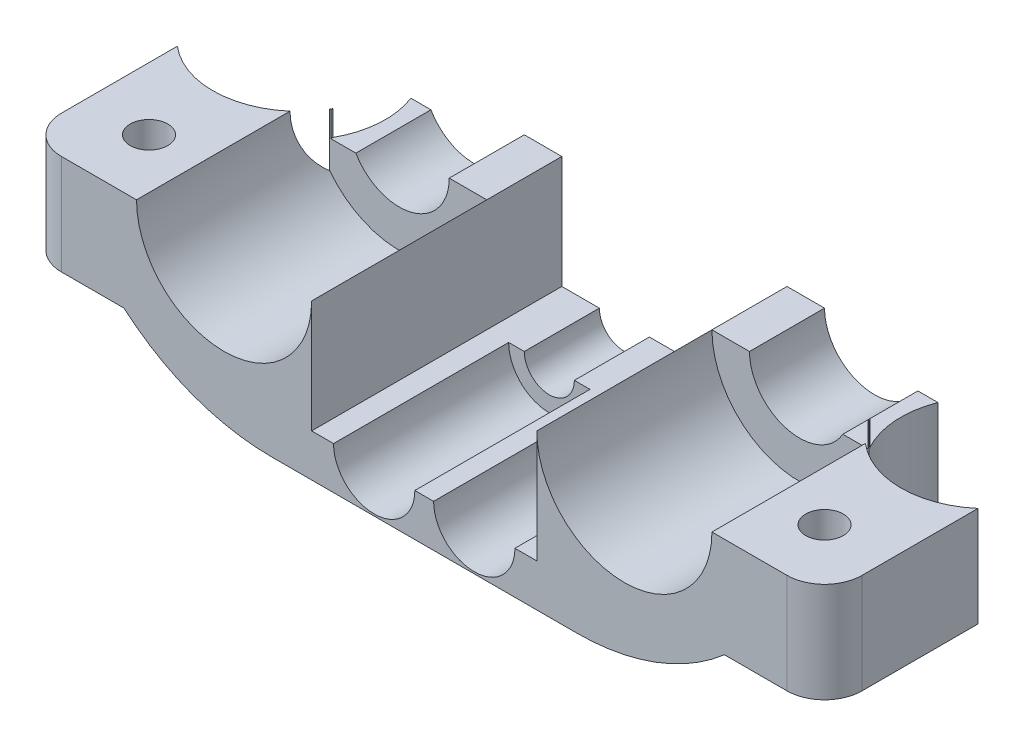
ISO-10303-21;
HEADER;
FILE_DESCRIPTION(('STEP AP214'),'2;1');
FILE_NAME('part.step','',(''),(''),'','','');
FILE_SCHEMA(('AUTOMOTIVE_DESIGN { 1 0 10303 214 1 1 1 1 }'));
ENDSEC;
DATA;
#1=APPLICATION_CONTEXT('core data for automotive mechanical design processes');
#2=APPLICATION_PROTOCOL_DEFINITION('international standard','automotive_design',2000,#1);
#3=PRODUCT_CONTEXT('',#1,'mechanical');
#4=PRODUCT('Part','Part','',(#3));
#5=PRODUCT_RELATED_PRODUCT_CATEGORY('part','',(#4));
#6=PRODUCT_DEFINITION_FORMATION('','',#4);
#7=PRODUCT_DEFINITION_CONTEXT('part definition',#1,'design');
#8=PRODUCT_DEFINITION('design','',#6,#7);
#9=PRODUCT_DEFINITION_SHAPE('','',#8);
#10=(LENGTH_UNIT() NAMED_UNIT(*) SI_UNIT(.MILLI.,.METRE.));
#11=(NAMED_UNIT(*) PLANE_ANGLE_UNIT() SI_UNIT($,.RADIAN.));
#12=(NAMED_UNIT(*) SI_UNIT($,.STERADIAN.) SOLID_ANGLE_UNIT());
#13=UNCERTAINTY_MEASURE_WITH_UNIT(LENGTH_MEASURE(1.E-05),#10,'distance_accuracy_value','');
#14=(GEOMETRIC_REPRESENTATION_CONTEXT(3) GLOBAL_UNCERTAINTY_ASSIGNED_CONTEXT((#13)) GLOBAL_UNIT_ASSIGNED_CONTEXT((#10,
#11,#12)) REPRESENTATION_CONTEXT('',''));
#15=CARTESIAN_POINT('',(0.,0.,0.));
#16=DIRECTION('',(0.,0.,1.));
#17=DIRECTION('',(1.,0.,0.));
#18=AXIS2_PLACEMENT_3D('',#15,#16,#17);
#19=CARTESIAN_POINT('',(4.,3.40000000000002,20.));
#20=DIRECTION('',(0.,0.,-1.));
#21=DIRECTION('',(-1.,0.,0.));
#22=AXIS2_PLACEMENT_3D('',#19,#20,#21);
#23=CYLINDRICAL_SURFACE('',#22,2.);
#24=CARTESIAN_POINT('',(4.,3.40000000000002,6.00000000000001));
#25=DIRECTION('',(0.,0.,1.));
#26=DIRECTION('',(1.,0.,0.));
#27=AXIS2_PLACEMENT_3D('',#24,#25,#26);
#28=CIRCLE('',#27,2.);
#29=CARTESIAN_POINT('',(6.,3.40000000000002,6.00000000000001));
#30=VERTEX_POINT('',#29);
#31=CARTESIAN_POINT('',(1.99999999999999,3.40000000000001,6.00000000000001));
#32=VERTEX_POINT('',#31);
#33=EDGE_CURVE('E290',#30,#32,#28,.F.);
#34=ORIENTED_EDGE('',*,*,#33,.F.);
#35=DIRECTION('',(0.,0.,-1.));
#36=VECTOR('',#35,1.);
#37=CARTESIAN_POINT('',(6.,3.40000000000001,20.));
#38=LINE('',#37,#36);
#39=CARTESIAN_POINT('',(6.,3.40000000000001,0.));
#40=VERTEX_POINT('',#39);
#41=EDGE_CURVE('E303',#30,#40,#38,.T.);
#42=ORIENTED_EDGE('',*,*,#41,.T.);
#43=CARTESIAN_POINT('',(4.,3.40000000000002,0.));
#44=DIRECTION('',(0.,0.,-1.));
#45=DIRECTION('',(1.,0.,0.));
#46=AXIS2_PLACEMENT_3D('',#43,#44,#45);
#47=CIRCLE('',#46,2.);
#48=CARTESIAN_POINT('',(1.99999999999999,3.40000000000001,0.));
#49=VERTEX_POINT('',#48);
#50=EDGE_CURVE('E585',#40,#49,#47,.T.);
#51=ORIENTED_EDGE('',*,*,#50,.T.);
#52=DIRECTION('',(0.,0.,-1.));
#53=VECTOR('',#52,1.);
#54=CARTESIAN_POINT('',(1.99999999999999,3.40000000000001,20.));
#55=LINE('',#54,#53);
#56=EDGE_CURVE('E516',#32,#49,#55,.T.);
#57=ORIENTED_EDGE('',*,*,#56,.F.);
#58=EDGE_LOOP('',(#34,#42,#51,#57));
#59=FACE_BOUND('',#58,.T.);
#60=ADVANCED_FACE('F30',(#59),#23,.F.);
#61=CARTESIAN_POINT('',(-4.,3.40000000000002,20.));
#62=DIRECTION('',(0.,0.,-1.));
#63=DIRECTION('',(-1.,0.,0.));
#64=AXIS2_PLACEMENT_3D('',#61,#62,#63);
#65=CYLINDRICAL_SURFACE('',#64,2.);
#66=CARTESIAN_POINT('',(-4.,3.40000000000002,6.00000000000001));
#67=DIRECTION('',(0.,0.,1.));
#68=DIRECTION('',(1.,0.,0.));
#69=AXIS2_PLACEMENT_3D('',#66,#67,#68);
#70=CIRCLE('',#69,2.);
#71=CARTESIAN_POINT('',(-2.,3.40000000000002,6.00000000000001));
#72=VERTEX_POINT('',#71);
#73=CARTESIAN_POINT('',(-6.00000000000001,3.40000000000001,6.00000000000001));
#74=VERTEX_POINT('',#73);
#75=EDGE_CURVE('E319',#72,#74,#70,.F.);
#76=ORIENTED_EDGE('',*,*,#75,.F.);
#77=DIRECTION('',(0.,0.,-1.));
#78=VECTOR('',#77,1.);
#79=CARTESIAN_POINT('',(-2.,3.40000000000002,20.));
#80=LINE('',#79,#78);
#81=CARTESIAN_POINT('',(-2.,3.40000000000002,0.));
#82=VERTEX_POINT('',#81);
#83=EDGE_CURVE('E518',#72,#82,#80,.T.);
#84=ORIENTED_EDGE('',*,*,#83,.T.);
#85=CARTESIAN_POINT('',(-4.,3.40000000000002,0.));
#86=DIRECTION('',(0.,0.,-1.));
#87=DIRECTION('',(1.,0.,0.));
#88=AXIS2_PLACEMENT_3D('',#85,#86,#87);
#89=CIRCLE('',#88,2.);
#90=CARTESIAN_POINT('',(-6.00000000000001,3.40000000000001,0.));
#91=VERTEX_POINT('',#90);
#92=EDGE_CURVE('E579',#82,#91,#89,.T.);
#93=ORIENTED_EDGE('',*,*,#92,.T.);
#94=DIRECTION('',(0.,0.,-1.));
#95=VECTOR('',#94,1.);
#96=CARTESIAN_POINT('',(-6.00000000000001,3.40000000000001,20.));
#97=LINE('',#96,#95);
#98=EDGE_CURVE('E520',#74,#91,#97,.T.);
#99=ORIENTED_EDGE('',*,*,#98,.F.);
#100=EDGE_LOOP('',(#76,#84,#93,#99));
#101=FACE_BOUND('',#100,.T.);
#102=ADVANCED_FACE('F638',(#101),#65,.F.);
#103=CARTESIAN_POINT('',(21.4641016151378,12.4,20.));
#104=DIRECTION('',(0.,-1.,0.));
#105=DIRECTION('',(1.,0.,0.));
#106=AXIS2_PLACEMENT_3D('',#103,#104,#105);
#107=PLANE('',#106);
#108=DIRECTION('',(-1.,0.,0.));
#109=VECTOR('',#108,1.);
#110=CARTESIAN_POINT('',(21.4641016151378,12.4,6.00000000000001));
#111=LINE('',#110,#109);
#112=CARTESIAN_POINT('',(21.5535725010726,12.4,6.00000000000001));
#113=VERTEX_POINT('',#112);
#114=CARTESIAN_POINT('',(21.4641016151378,12.4,6.00000000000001));
#115=VERTEX_POINT('',#114);
#116=EDGE_CURVE('E328',#113,#115,#111,.T.);
#117=ORIENTED_EDGE('',*,*,#116,.F.);
#118=CARTESIAN_POINT('',(27.5,12.4,2.5));
#119=DIRECTION('',(0.,-1.,0.));
#120=DIRECTION('',(1.,0.,0.));
#121=AXIS2_PLACEMENT_3D('',#118,#119,#120);
#122=CIRCLE('',#121,6.90000000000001);
#123=CARTESIAN_POINT('',(21.4641016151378,12.4,5.84334124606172));
#124=VERTEX_POINT('',#123);
#125=EDGE_CURVE('E386',#113,#124,#122,.T.);
#126=ORIENTED_EDGE('',*,*,#125,.T.);
#127=DIRECTION('',(0.,0.,-1.));
#128=VECTOR('',#127,1.);
#129=CARTESIAN_POINT('',(21.4641016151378,12.4,20.));
#130=LINE('',#129,#128);
#131=EDGE_CURVE('E500',#115,#124,#130,.T.);
#132=ORIENTED_EDGE('',*,*,#131,.F.);
#133=EDGE_LOOP('',(#117,#126,#132));
#134=FACE_BOUND('',#133,.T.);
#135=ADVANCED_FACE('F644',(#134),#107,.F.);
#136=CARTESIAN_POINT('',(21.4641016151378,10.4,20.));
#137=DIRECTION('',(1.,0.,0.));
#138=DIRECTION('',(0.,0.,-1.));
#139=AXIS2_PLACEMENT_3D('',#136,#137,#138);
#140=PLANE('',#139);
#141=DIRECTION('',(0.,-1.,0.));
#142=VECTOR('',#141,1.);
#143=CARTESIAN_POINT('',(21.4641016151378,10.4,6.00000000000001));
#144=LINE('',#143,#142);
#145=CARTESIAN_POINT('',(21.4641016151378,10.4,6.00000000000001));
#146=VERTEX_POINT('',#145);
#147=EDGE_CURVE('E330',#115,#146,#144,.T.);
#148=ORIENTED_EDGE('',*,*,#147,.F.);
#149=ORIENTED_EDGE('',*,*,#131,.T.);
#150=DIRECTION('',(0.,-1.,0.));
#151=VECTOR('',#150,1.);
#152=CARTESIAN_POINT('',(21.4641016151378,14.4,5.84334124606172));
#153=LINE('',#152,#151);
#154=CARTESIAN_POINT('',(21.4641016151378,10.4,5.84334124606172));
#155=VERTEX_POINT('',#154);
#156=EDGE_CURVE('E382',#124,#155,#153,.T.);
#157=ORIENTED_EDGE('',*,*,#156,.T.);
#158=DIRECTION('',(0.,0.,-1.));
#159=VECTOR('',#158,1.);
#160=CARTESIAN_POINT('',(21.4641016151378,10.4,20.));
#161=LINE('',#160,#159);
#162=EDGE_CURVE('E502',#146,#155,#161,.T.);
#163=ORIENTED_EDGE('',*,*,#162,.F.);
#164=EDGE_LOOP('',(#148,#149,#157,#163));
#165=FACE_BOUND('',#164,.T.);
#166=ADVANCED_FACE('F669',(#165),#140,.F.);
#167=CARTESIAN_POINT('',(19.4641016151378,10.4,20.));
#168=DIRECTION('',(0.,-1.,0.));
#169=DIRECTION('',(0.,0.,-1.));
#170=AXIS2_PLACEMENT_3D('',#167,#168,#169);
#171=PLANE('',#170);
#172=DIRECTION('',(-1.,0.,0.));
#173=VECTOR('',#172,1.);
#174=CARTESIAN_POINT('',(19.4641016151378,10.4,6.00000000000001));
#175=LINE('',#174,#173);
#176=CARTESIAN_POINT('',(19.4641016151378,10.4,6.00000000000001));
#177=VERTEX_POINT('',#176);
#178=EDGE_CURVE('E332',#146,#177,#175,.T.);
#179=ORIENTED_EDGE('',*,*,#178,.F.);
#180=ORIENTED_EDGE('',*,*,#162,.T.);
#181=CARTESIAN_POINT('',(27.5,10.4,2.5));
#182=DIRECTION('',(0.,-1.,0.));
#183=DIRECTION('',(0.,0.,-1.));
#184=AXIS2_PLACEMENT_3D('',#181,#182,#183);
#185=CIRCLE('',#184,6.90000000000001);
#186=CARTESIAN_POINT('',(21.0688259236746,10.4,0.));
#187=VERTEX_POINT('',#186);
#188=EDGE_CURVE('E379',#155,#187,#185,.T.);
#189=ORIENTED_EDGE('',*,*,#188,.T.);
#190=DIRECTION('',(-1.,0.,0.));
#191=VECTOR('',#190,1.);
#192=CARTESIAN_POINT('',(19.4641016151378,10.4,0.));
#193=LINE('',#192,#191);
#194=CARTESIAN_POINT('',(19.4641016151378,10.4,0.));
#195=VERTEX_POINT('',#194);
#196=EDGE_CURVE('E598',#187,#195,#193,.T.);
#197=ORIENTED_EDGE('',*,*,#196,.T.);
#198=DIRECTION('',(0.,0.,-1.));
#199=VECTOR('',#198,1.);
#200=CARTESIAN_POINT('',(19.4641016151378,10.4,20.));
#201=LINE('',#200,#199);
#202=EDGE_CURVE('E504',#177,#195,#201,.T.);
#203=ORIENTED_EDGE('',*,*,#202,.F.);
#204=EDGE_LOOP('',(#179,#180,#189,#197,#203));
#205=FACE_BOUND('',#204,.T.);
#206=ADVANCED_FACE('F665',(#205),#171,.F.);
#207=CARTESIAN_POINT('',(16.,12.4,20.));
#208=DIRECTION('',(0.,0.,-1.));
#209=DIRECTION('',(-1.,0.,0.));
#210=AXIS2_PLACEMENT_3D('',#207,#208,#209);
#211=CYLINDRICAL_SURFACE('',#210,4.);
#212=CARTESIAN_POINT('',(16.,12.4,6.00000000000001));
#213=DIRECTION('',(0.,0.,1.));
#214=DIRECTION('',(1.,0.,0.));
#215=AXIS2_PLACEMENT_3D('',#212,#213,#214);
#216=CIRCLE('',#215,4.);
#217=CARTESIAN_POINT('',(12.,12.4,6.00000000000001));
#218=VERTEX_POINT('',#217);
#219=EDGE_CURVE('E334',#177,#218,#216,.F.);
#220=ORIENTED_EDGE('',*,*,#219,.F.);
#221=ORIENTED_EDGE('',*,*,#202,.T.);
#222=CARTESIAN_POINT('',(16.,12.4,0.));
#223=DIRECTION('',(0.,0.,-1.));
#224=DIRECTION('',(1.,0.,0.));
#225=AXIS2_PLACEMENT_3D('',#222,#223,#224);
#226=CIRCLE('',#225,4.);
#227=CARTESIAN_POINT('',(12.,12.4,0.));
#228=VERTEX_POINT('',#227);
#229=EDGE_CURVE('E595',#195,#228,#226,.T.);
#230=ORIENTED_EDGE('',*,*,#229,.T.);
#231=DIRECTION('',(0.,0.,-1.));
#232=VECTOR('',#231,1.);
#233=CARTESIAN_POINT('',(12.,12.4,20.));
#234=LINE('',#233,#232);
#235=EDGE_CURVE('E506',#218,#228,#234,.T.);
#236=ORIENTED_EDGE('',*,*,#235,.F.);
#237=EDGE_LOOP('',(#220,#221,#230,#236));
#238=FACE_BOUND('',#237,.T.);
#239=ADVANCED_FACE('F661',(#238),#211,.F.);
#240=CARTESIAN_POINT('',(9.,12.4,20.));
#241=DIRECTION('',(0.,-1.,0.));
#242=DIRECTION('',(1.,0.,0.));
#243=AXIS2_PLACEMENT_3D('',#240,#241,#242);
#244=PLANE('',#243);
#245=DIRECTION('',(-1.,0.,0.));
#246=VECTOR('',#245,1.);
#247=CARTESIAN_POINT('',(9.,12.4,6.00000000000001));
#248=LINE('',#247,#246);
#249=CARTESIAN_POINT('',(9.,12.4,6.00000000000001));
#250=VERTEX_POINT('',#249);
#251=EDGE_CURVE('E336',#218,#250,#248,.T.);
#252=ORIENTED_EDGE('',*,*,#251,.F.);
#253=ORIENTED_EDGE('',*,*,#235,.T.);
#254=DIRECTION('',(-1.,0.,0.));
#255=VECTOR('',#254,1.);
#256=CARTESIAN_POINT('',(9.,12.4,0.));
#257=LINE('',#256,#255);
#258=CARTESIAN_POINT('',(9.,12.4,0.));
#259=VERTEX_POINT('',#258);
#260=EDGE_CURVE('E592',#228,#259,#257,.T.);
#261=ORIENTED_EDGE('',*,*,#260,.T.);
#262=DIRECTION('',(0.,0.,-1.));
#263=VECTOR('',#262,1.);
#264=CARTESIAN_POINT('',(9.,12.4,20.));
#265=LINE('',#264,#263);
#266=EDGE_CURVE('E511',#250,#259,#265,.T.);
#267=ORIENTED_EDGE('',*,*,#266,.F.);
#268=EDGE_LOOP('',(#252,#253,#261,#267));
#269=FACE_BOUND('',#268,.T.);
#270=ADVANCED_FACE('F657',(#269),#244,.F.);
#271=CARTESIAN_POINT('',(-12.,12.4,20.));
#272=DIRECTION('',(0.,-1.,0.));
#273=DIRECTION('',(0.,0.,-1.));
#274=AXIS2_PLACEMENT_3D('',#271,#272,#273);
#275=PLANE('',#274);
#276=DIRECTION('',(-1.,0.,0.));
#277=VECTOR('',#276,1.);
#278=CARTESIAN_POINT('',(-12.,12.4,6.00000000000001));
#279=LINE('',#278,#277);
#280=CARTESIAN_POINT('',(-9.,12.4,6.00000000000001));
#281=VERTEX_POINT('',#280);
#282=CARTESIAN_POINT('',(-12.,12.4,6.00000000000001));
#283=VERTEX_POINT('',#282);
#284=EDGE_CURVE('E354',#281,#283,#279,.T.);
#285=ORIENTED_EDGE('',*,*,#284,.F.);
#286=DIRECTION('',(0.,0.,-1.));
#287=VECTOR('',#286,1.);
#288=CARTESIAN_POINT('',(-9.00000000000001,12.4,20.));
#289=LINE('',#288,#287);
#290=CARTESIAN_POINT('',(-9.00000000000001,12.4,0.));
#291=VERTEX_POINT('',#290);
#292=EDGE_CURVE('E527',#281,#291,#289,.T.);
#293=ORIENTED_EDGE('',*,*,#292,.T.);
#294=DIRECTION('',(-1.,0.,0.));
#295=VECTOR('',#294,1.);
#296=CARTESIAN_POINT('',(-12.,12.4,0.));
#297=LINE('',#296,#295);
#298=CARTESIAN_POINT('',(-12.,12.4,0.));
#299=VERTEX_POINT('',#298);
#300=EDGE_CURVE('E571',#291,#299,#297,.T.);
#301=ORIENTED_EDGE('',*,*,#300,.T.);
#302=DIRECTION('',(0.,0.,-1.));
#303=VECTOR('',#302,1.);
#304=CARTESIAN_POINT('',(-12.,12.4,20.));
#305=LINE('',#304,#303);
#306=EDGE_CURVE('E528',#283,#299,#305,.T.);
#307=ORIENTED_EDGE('',*,*,#306,.F.);
#308=EDGE_LOOP('',(#285,#293,#301,#307));
#309=FACE_BOUND('',#308,.T.);
#310=ADVANCED_FACE('F660',(#309),#275,.F.);
#311=CARTESIAN_POINT('',(-16.,12.4,20.));
#312=DIRECTION('',(0.,0.,-1.));
#313=DIRECTION('',(-1.,0.,0.));
#314=AXIS2_PLACEMENT_3D('',#311,#312,#313);
#315=CYLINDRICAL_SURFACE('',#314,4.);
#316=CARTESIAN_POINT('',(-16.,12.4,6.00000000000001));
#317=DIRECTION('',(0.,0.,1.));
#318=DIRECTION('',(1.,0.,0.));
#319=AXIS2_PLACEMENT_3D('',#316,#317,#318);
#320=CIRCLE('',#319,4.);
#321=CARTESIAN_POINT('',(-19.4641016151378,10.4,6.00000000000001));
#322=VERTEX_POINT('',#321);
#323=EDGE_CURVE('E352',#283,#322,#320,.F.);
#324=ORIENTED_EDGE('',*,*,#323,.F.);
#325=ORIENTED_EDGE('',*,*,#306,.T.);
#326=CARTESIAN_POINT('',(-16.,12.4,0.));
#327=DIRECTION('',(0.,0.,-1.));
#328=DIRECTION('',(1.,0.,0.));
#329=AXIS2_PLACEMENT_3D('',#326,#327,#328);
#330=CIRCLE('',#329,4.);
#331=CARTESIAN_POINT('',(-19.4641016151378,10.4,0.));
#332=VERTEX_POINT('',#331);
#333=EDGE_CURVE('E568',#299,#332,#330,.T.);
#334=ORIENTED_EDGE('',*,*,#333,.T.);
#335=DIRECTION('',(0.,0.,-1.));
#336=VECTOR('',#335,1.);
#337=CARTESIAN_POINT('',(-19.4641016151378,10.4,20.));
#338=LINE('',#337,#336);
#339=EDGE_CURVE('E530',#322,#332,#338,.T.);
#340=ORIENTED_EDGE('',*,*,#339,.F.);
#341=EDGE_LOOP('',(#324,#325,#334,#340));
#342=FACE_BOUND('',#341,.T.);
#343=ADVANCED_FACE('F896',(#342),#315,.F.);
#344=CARTESIAN_POINT('',(-19.4641016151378,10.4,20.));
#345=DIRECTION('',(0.,-1.,0.));
#346=DIRECTION('',(1.,0.,0.));
#347=AXIS2_PLACEMENT_3D('',#344,#345,#346);
#348=PLANE('',#347);
#349=DIRECTION('',(-1.,0.,0.));
#350=VECTOR('',#349,1.);
#351=CARTESIAN_POINT('',(-19.4641016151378,10.4,6.00000000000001));
#352=LINE('',#351,#350);
#353=CARTESIAN_POINT('',(-21.4641016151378,10.4,6.00000000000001));
#354=VERTEX_POINT('',#353);
#355=EDGE_CURVE('E350',#322,#354,#352,.T.);
#356=ORIENTED_EDGE('',*,*,#355,.F.);
#357=ORIENTED_EDGE('',*,*,#339,.T.);
#358=DIRECTION('',(-1.,0.,0.));
#359=VECTOR('',#358,1.);
#360=CARTESIAN_POINT('',(-19.4641016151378,10.4,0.));
#361=LINE('',#360,#359);
#362=CARTESIAN_POINT('',(-21.0688259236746,10.4,0.));
#363=VERTEX_POINT('',#362);
#364=EDGE_CURVE('E565',#332,#363,#361,.T.);
#365=ORIENTED_EDGE('',*,*,#364,.T.);
#366=CARTESIAN_POINT('',(-27.5,10.4,2.5));
#367=DIRECTION('',(0.,-1.,0.));
#368=DIRECTION('',(1.,0.,0.));
#369=AXIS2_PLACEMENT_3D('',#366,#367,#368);
#370=CIRCLE('',#369,6.9);
#371=CARTESIAN_POINT('',(-21.4641016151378,10.4,5.84334124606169));
#372=VERTEX_POINT('',#371);
#373=EDGE_CURVE('E404',#363,#372,#370,.T.);
#374=ORIENTED_EDGE('',*,*,#373,.T.);
#375=DIRECTION('',(0.,0.,-1.));
#376=VECTOR('',#375,1.);
#377=CARTESIAN_POINT('',(-21.4641016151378,10.4,20.));
#378=LINE('',#377,#376);
#379=EDGE_CURVE('E532',#354,#372,#378,.T.);
#380=ORIENTED_EDGE('',*,*,#379,.F.);
#381=EDGE_LOOP('',(#356,#357,#365,#374,#380));
#382=FACE_BOUND('',#381,.T.);
#383=ADVANCED_FACE('F763',(#382),#348,.F.);
#384=CARTESIAN_POINT('',(-21.4641016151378,10.4,20.));
#385=DIRECTION('',(-1.,0.,0.));
#386=DIRECTION('',(0.,0.,1.));
#387=AXIS2_PLACEMENT_3D('',#384,#385,#386);
#388=PLANE('',#387);
#389=DIRECTION('',(0.,1.,0.));
#390=VECTOR('',#389,1.);
#391=CARTESIAN_POINT('',(-21.4641016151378,10.4,6.00000000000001));
#392=LINE('',#391,#390);
#393=CARTESIAN_POINT('',(-21.4641016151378,12.4,6.00000000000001));
#394=VERTEX_POINT('',#393);
#395=EDGE_CURVE('E348',#354,#394,#392,.T.);
#396=ORIENTED_EDGE('',*,*,#395,.F.);
#397=ORIENTED_EDGE('',*,*,#379,.T.);
#398=DIRECTION('',(0.,-1.,0.));
#399=VECTOR('',#398,1.);
#400=CARTESIAN_POINT('',(-21.4641016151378,14.4,5.84334124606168));
#401=LINE('',#400,#399);
#402=CARTESIAN_POINT('',(-21.4641016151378,12.4,5.84334124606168));
#403=VERTEX_POINT('',#402);
#404=EDGE_CURVE('E608',#372,#403,#401,.F.);
#405=ORIENTED_EDGE('',*,*,#404,.T.);
#406=DIRECTION('',(0.,0.,-1.));
#407=VECTOR('',#406,1.);
#408=CARTESIAN_POINT('',(-21.4641016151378,12.4,20.));
#409=LINE('',#408,#407);
#410=EDGE_CURVE('E534',#394,#403,#409,.T.);
#411=ORIENTED_EDGE('',*,*,#410,.F.);
#412=EDGE_LOOP('',(#396,#397,#405,#411));
#413=FACE_BOUND('',#412,.T.);
#414=ADVANCED_FACE('F758',(#413),#388,.F.);
#415=CARTESIAN_POINT('',(-32.,12.4,20.));
#416=DIRECTION('',(0.,-1.,0.));
#417=DIRECTION('',(1.,0.,0.));
#418=AXIS2_PLACEMENT_3D('',#415,#416,#417);
#419=PLANE('',#418);
#420=DIRECTION('',(-1.,0.,0.));
#421=VECTOR('',#420,1.);
#422=CARTESIAN_POINT('',(-32.,12.4,6.00000000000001));
#423=LINE('',#422,#421);
#424=CARTESIAN_POINT('',(-21.5535725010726,12.4,6.));
#425=VERTEX_POINT('',#424);
#426=EDGE_CURVE('E346',#394,#425,#423,.T.);
#427=ORIENTED_EDGE('',*,*,#426,.F.);
#428=ORIENTED_EDGE('',*,*,#410,.T.);
#429=CARTESIAN_POINT('',(-27.5,12.4,2.5));
#430=DIRECTION('',(0.,-1.,0.));
#431=DIRECTION('',(1.,0.,0.));
#432=AXIS2_PLACEMENT_3D('',#429,#430,#431);
#433=CIRCLE('',#432,6.9);
#434=EDGE_CURVE('E611',#403,#425,#433,.T.);
#435=ORIENTED_EDGE('',*,*,#434,.T.);
#436=EDGE_LOOP('',(#427,#428,#435));
#437=FACE_BOUND('',#436,.T.);
#438=ADVANCED_FACE('F754',(#437),#419,.F.);
#439=CARTESIAN_POINT('',(27.,14.4,15.));
#440=DIRECTION('',(0.,-1.,0.));
#441=DIRECTION('',(1.,0.,0.));
#442=AXIS2_PLACEMENT_3D('',#439,#440,#441);
#443=CYLINDRICAL_SURFACE('',#442,1.5);
#444=CARTESIAN_POINT('',(27.,12.4,15.));
#445=DIRECTION('',(0.,-1.,0.));
#446=DIRECTION('',(1.,0.,0.));
#447=AXIS2_PLACEMENT_3D('',#444,#445,#446);
#448=CIRCLE('',#447,1.5);
#449=CARTESIAN_POINT('',(28.5,12.4,15.));
#450=VERTEX_POINT('',#449);
#451=EDGE_CURVE('E383',#450,#450,#448,.T.);
#452=ORIENTED_EDGE('',*,*,#451,.F.);
#453=EDGE_LOOP('',(#452));
#454=FACE_BOUND('',#453,.T.);
#455=CARTESIAN_POINT('',(27.,7.39999999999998,15.));
#456=DIRECTION('',(0.,-1.,0.));
#457=DIRECTION('',(1.,0.,0.));
#458=AXIS2_PLACEMENT_3D('',#455,#456,#457);
#459=CIRCLE('',#458,1.5);
#460=CARTESIAN_POINT('',(28.5,7.39999999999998,15.));
#461=VERTEX_POINT('',#460);
#462=EDGE_CURVE('E368',#461,#461,#459,.F.);
#463=ORIENTED_EDGE('',*,*,#462,.F.);
#464=EDGE_LOOP('',(#463));
#465=FACE_BOUND('',#464,.T.);
#466=ADVANCED_FACE('F418',(#454,#465),#443,.F.);
#467=CARTESIAN_POINT('',(-27.,14.4,15.));
#468=DIRECTION('',(0.,-1.,0.));
#469=DIRECTION('',(1.,0.,0.));
#470=AXIS2_PLACEMENT_3D('',#467,#468,#469);
#471=CYLINDRICAL_SURFACE('',#470,1.5);
#472=CARTESIAN_POINT('',(-27.,12.4,15.));
#473=DIRECTION('',(0.,-1.,0.));
#474=DIRECTION('',(1.,0.,0.));
#475=AXIS2_PLACEMENT_3D('',#472,#473,#474);
#476=CIRCLE('',#475,1.5);
#477=CARTESIAN_POINT('',(-25.5,12.4,15.));
#478=VERTEX_POINT('',#477);
#479=EDGE_CURVE('E470',#478,#478,#476,.T.);
#480=ORIENTED_EDGE('',*,*,#479,.F.);
#481=EDGE_LOOP('',(#480));
#482=FACE_BOUND('',#481,.T.);
#483=CARTESIAN_POINT('',(-27.,7.4,15.));
#484=DIRECTION('',(0.,-1.,0.));
#485=DIRECTION('',(1.,0.,0.));
#486=AXIS2_PLACEMENT_3D('',#483,#484,#485);
#487=CIRCLE('',#486,1.5);
#488=CARTESIAN_POINT('',(-25.5,7.4,15.));
#489=VERTEX_POINT('',#488);
#490=EDGE_CURVE('E378',#489,#489,#487,.F.);
#491=ORIENTED_EDGE('',*,*,#490,.F.);
#492=EDGE_LOOP('',(#491));
#493=FACE_BOUND('',#492,.T.);
#494=ADVANCED_FACE('F636',(#482,#493),#471,.F.);
#495=CARTESIAN_POINT('',(-32.,4.4,20.));
#496=DIRECTION('',(1.,0.,0.));
#497=DIRECTION('',(0.,0.,-1.));
#498=AXIS2_PLACEMENT_3D('',#495,#496,#497);
#499=PLANE('',#498);
#500=DIRECTION('',(0.,0.,-1.));
#501=VECTOR('',#500,1.);
#502=CARTESIAN_POINT('',(-32.,4.4,20.));
#503=LINE('',#502,#501);
#504=CARTESIAN_POINT('',(-32.,4.4,17.));
#505=VERTEX_POINT('',#504);
#506=CARTESIAN_POINT('',(-32.,4.4,7.73067873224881));
#507=VERTEX_POINT('',#506);
#508=EDGE_CURVE('E480',#505,#507,#503,.T.);
#509=ORIENTED_EDGE('',*,*,#508,.F.);
#510=DIRECTION('',(0.,-1.,0.));
#511=VECTOR('',#510,1.);
#512=CARTESIAN_POINT('',(-32.,12.4,17.));
#513=LINE('',#512,#511);
#514=CARTESIAN_POINT('',(-32.,12.4,17.));
#515=VERTEX_POINT('',#514);
#516=EDGE_CURVE('E38',#505,#515,#513,.F.);
#517=ORIENTED_EDGE('',*,*,#516,.T.);
#518=DIRECTION('',(0.,0.,-1.));
#519=VECTOR('',#518,1.);
#520=CARTESIAN_POINT('',(-32.,12.4,20.));
#521=LINE('',#520,#519);
#522=CARTESIAN_POINT('',(-32.,12.4,7.73067873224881));
#523=VERTEX_POINT('',#522);
#524=EDGE_CURVE('E536',#515,#523,#521,.T.);
#525=ORIENTED_EDGE('',*,*,#524,.T.);
#526=DIRECTION('',(0.,-1.,0.));
#527=VECTOR('',#526,1.);
#528=CARTESIAN_POINT('',(-32.,14.4,7.73067873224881));
#529=LINE('',#528,#527);
#530=EDGE_CURVE('E615',#523,#507,#529,.T.);
#531=ORIENTED_EDGE('',*,*,#530,.T.);
#532=EDGE_LOOP('',(#509,#517,#525,#531));
#533=FACE_BOUND('',#532,.T.);
#534=ADVANCED_FACE('F32',(#533),#499,.F.);
#535=CARTESIAN_POINT('',(-24.,4.4,20.));
#536=DIRECTION('',(0.,1.,0.));
#537=DIRECTION('',(-1.,0.,0.));
#538=AXIS2_PLACEMENT_3D('',#535,#536,#537);
#539=PLANE('',#538);
#540=DIRECTION('',(1.,0.,0.));
#541=VECTOR('',#540,1.);
#542=CARTESIAN_POINT('',(-24.,4.4,20.));
#543=LINE('',#542,#541);
#544=CARTESIAN_POINT('',(-29.,4.4,20.));
#545=VERTEX_POINT('',#544);
#546=CARTESIAN_POINT('',(-24.,4.39999999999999,20.));
#547=VERTEX_POINT('',#546);
#548=EDGE_CURVE('E563',#545,#547,#543,.T.);
#549=ORIENTED_EDGE('',*,*,#548,.F.);
#550=CARTESIAN_POINT('',(-29.,4.4,17.));
#551=DIRECTION('',(0.,1.,0.));
#552=DIRECTION('',(-1.,0.,0.));
#553=AXIS2_PLACEMENT_3D('',#550,#551,#552);
#554=CIRCLE('',#553,3.);
#555=EDGE_CURVE('E52',#545,#505,#554,.F.);
#556=ORIENTED_EDGE('',*,*,#555,.T.);
#557=ORIENTED_EDGE('',*,*,#508,.T.);
#558=CARTESIAN_POINT('',(-27.5,4.4,2.5));
#559=DIRECTION('',(0.,1.,0.));
#560=DIRECTION('',(-1.,0.,0.));
#561=AXIS2_PLACEMENT_3D('',#558,#559,#560);
#562=CIRCLE('',#561,6.9);
#563=CARTESIAN_POINT('',(-24.,4.39999999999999,8.4464274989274));
#564=VERTEX_POINT('',#563);
#565=EDGE_CURVE('E618',#507,#564,#562,.T.);
#566=ORIENTED_EDGE('',*,*,#565,.T.);
#567=DIRECTION('',(0.,0.,-1.));
#568=VECTOR('',#567,1.);
#569=CARTESIAN_POINT('',(-24.,4.39999999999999,20.));
#570=LINE('',#569,#568);
#571=CARTESIAN_POINT('',(-24.,4.39999999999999,13.197224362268));
#572=VERTEX_POINT('',#571);
#573=EDGE_CURVE('E485',#572,#564,#570,.T.);
#574=ORIENTED_EDGE('',*,*,#573,.F.);
#575=CARTESIAN_POINT('',(-27.,4.4,15.));
#576=DIRECTION('',(0.,-1.,0.));
#577=DIRECTION('',(1.,0.,0.));
#578=AXIS2_PLACEMENT_3D('',#575,#576,#577);
#579=CIRCLE('',#578,3.5);
#580=CARTESIAN_POINT('',(-24.,4.4,16.802775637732));
#581=VERTEX_POINT('',#580);
#582=EDGE_CURVE('E369',#581,#572,#579,.T.);
#583=ORIENTED_EDGE('',*,*,#582,.F.);
#584=EDGE_CURVE('E482',#547,#581,#570,.T.);
#585=ORIENTED_EDGE('',*,*,#584,.F.);
#586=EDGE_LOOP('',(#549,#556,#557,#566,#574,#583,#585));
#587=FACE_BOUND('',#586,.T.);
#588=ADVANCED_FACE('F630',(#587),#539,.F.);
#589=CARTESIAN_POINT('',(-12.2084776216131,18.,20.));
#590=DIRECTION('',(0.,0.,-1.));
#591=DIRECTION('',(-1.,0.,0.));
#592=AXIS2_PLACEMENT_3D('',#589,#590,#591);
#593=CYLINDRICAL_SURFACE('',#592,18.);
#594=ORIENTED_EDGE('',*,*,#584,.T.);
#595=DIRECTION('',(0.,0.,-1.));
#596=VECTOR('',#595,1.);
#597=CARTESIAN_POINT('',(-24.,4.4,20.));
#598=LINE('',#597,#596);
#599=EDGE_CURVE('E375',#581,#572,#598,.T.);
#600=ORIENTED_EDGE('',*,*,#599,.T.);
#601=ORIENTED_EDGE('',*,*,#573,.T.);
#602=CARTESIAN_POINT('',(-29.8448037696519,14.4,8.98936786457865));
#603=CARTESIAN_POINT('',(-29.7944994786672,14.1535557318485,9.00752642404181));
#604=CARTESIAN_POINT('',(-29.7390475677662,13.9082631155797,9.02691945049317));
#605=CARTESIAN_POINT('',(-29.6179535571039,13.4203359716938,9.06722203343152));
#606=CARTESIAN_POINT('',(-29.5523116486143,13.1777013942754,9.08813156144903));
#607=CARTESIAN_POINT('',(-29.4108323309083,12.6950658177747,9.13054801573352));
#608=CARTESIAN_POINT('',(-29.3349794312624,12.4550694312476,9.15205580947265));
#609=CARTESIAN_POINT('',(-29.1732702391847,11.9784425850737,9.19456114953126));
#610=CARTESIAN_POINT('',(-29.0874139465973,11.7418121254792,9.21555869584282));
#611=CARTESIAN_POINT('',(-28.8128826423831,11.0319968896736,9.27656584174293));
#612=CARTESIAN_POINT('',(-28.6088631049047,10.5644166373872,9.31405420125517));
#613=CARTESIAN_POINT('',(-28.1615109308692,9.64773065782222,9.37191583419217));
#614=CARTESIAN_POINT('',(-27.9182161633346,9.19860765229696,9.39230547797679));
#615=CARTESIAN_POINT('',(-27.4994348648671,8.49842086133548,9.40177749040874));
#616=CARTESIAN_POINT('',(-27.3359585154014,8.24025572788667,9.40014469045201));
#617=CARTESIAN_POINT('',(-26.9962488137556,7.73282007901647,9.38368833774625));
#618=CARTESIAN_POINT('',(-26.8200155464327,7.48354950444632,9.36886487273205));
#619=CARTESIAN_POINT('',(-26.4565880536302,6.99621122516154,9.32310012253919));
#620=CARTESIAN_POINT('',(-26.2694417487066,6.75810176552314,9.29222519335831));
#621=CARTESIAN_POINT('',(-25.8850866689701,6.29354242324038,9.21122960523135));
#622=CARTESIAN_POINT('',(-25.6878805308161,6.06708951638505,9.16111396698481));
#623=CARTESIAN_POINT('',(-25.3311488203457,5.6773099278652,9.05229353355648));
#624=CARTESIAN_POINT('',(-25.1731883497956,5.51128944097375,8.99809469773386));
#625=CARTESIAN_POINT('',(-24.8539926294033,5.18819005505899,8.87478652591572));
#626=CARTESIAN_POINT('',(-24.692758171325,5.031109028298,8.80568075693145));
#627=CARTESIAN_POINT('',(-24.3687887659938,4.72686170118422,8.65123600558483));
#628=CARTESIAN_POINT('',(-24.2060543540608,4.57969200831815,8.56590261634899));
#629=CARTESIAN_POINT('',(-23.8811716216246,4.29618066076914,8.3778637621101));
#630=CARTESIAN_POINT('',(-23.7190232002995,4.15983704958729,8.27516144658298));
#631=CARTESIAN_POINT('',(-23.4257923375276,3.92160910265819,8.07108175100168));
#632=CARTESIAN_POINT('',(-23.2942164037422,3.81785821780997,7.97258702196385));
#633=CARTESIAN_POINT('',(-23.0347531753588,3.61881515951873,7.7630187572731));
#634=CARTESIAN_POINT('',(-22.9068651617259,3.52352132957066,7.65194769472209));
#635=CARTESIAN_POINT('',(-22.65644998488,3.34176633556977,7.4172617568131));
#636=CARTESIAN_POINT('',(-22.5339221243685,3.25530402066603,7.29364852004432));
#637=CARTESIAN_POINT('',(-22.2959339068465,3.09147555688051,7.03416856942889));
#638=CARTESIAN_POINT('',(-22.1804736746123,3.01410956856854,6.89830163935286));
#639=CARTESIAN_POINT('',(-21.957799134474,2.86829368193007,6.61421168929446));
#640=CARTESIAN_POINT('',(-21.8506277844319,2.7998891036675,6.46593164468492));
#641=CARTESIAN_POINT('',(-21.6468240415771,2.67250617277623,6.15846246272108));
#642=CARTESIAN_POINT('',(-21.5501918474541,2.61352799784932,5.999273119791));
#643=CARTESIAN_POINT('',(-21.3690051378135,2.50497186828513,5.67112405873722));
#644=CARTESIAN_POINT('',(-21.28444980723,2.45539327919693,5.50216500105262));
#645=CARTESIAN_POINT('',(-21.128757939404,2.36552886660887,5.15580820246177));
#646=CARTESIAN_POINT('',(-21.0576203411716,2.32524230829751,4.97841113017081));
#647=CARTESIAN_POINT('',(-20.9354581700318,2.25692944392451,4.63247506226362));
#648=CARTESIAN_POINT('',(-20.8832203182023,2.22814014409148,4.4645135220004));
#649=CARTESIAN_POINT('',(-20.7915307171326,2.17805533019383,4.12404329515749));
#650=CARTESIAN_POINT('',(-20.7520785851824,2.1567595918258,3.95153474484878));
#651=CARTESIAN_POINT('',(-20.6864758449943,2.12155758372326,3.60330263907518));
#652=CARTESIAN_POINT('',(-20.6603225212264,2.10764980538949,3.42757974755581));
#653=CARTESIAN_POINT('',(-20.6216380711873,2.08713687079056,3.07421744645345));
#654=CARTESIAN_POINT('',(-20.6091068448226,2.080531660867,2.89657805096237));
#655=CARTESIAN_POINT('',(-20.5980051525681,2.07467855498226,2.54644891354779));
#656=CARTESIAN_POINT('',(-20.599000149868,2.0752016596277,2.3739765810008));
#657=CARTESIAN_POINT('',(-20.6138878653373,2.08305463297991,2.02974905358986));
#658=CARTESIAN_POINT('',(-20.6277801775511,2.09038428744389,1.85799383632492));
#659=CARTESIAN_POINT('',(-20.6682954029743,2.11189100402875,1.51644302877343));
#660=CARTESIAN_POINT('',(-20.6949170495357,2.12606738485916,1.34664724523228));
#661=CARTESIAN_POINT('',(-20.7605725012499,2.16134286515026,1.01020374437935));
#662=CARTESIAN_POINT('',(-20.7996063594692,2.18244199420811,0.843556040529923));
#663=CARTESIAN_POINT('',(-20.8894939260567,2.23159584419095,0.515022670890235));
#664=CARTESIAN_POINT('',(-20.9403155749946,2.25963171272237,0.353125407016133));
#665=CARTESIAN_POINT('',(-21.0532182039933,2.32279538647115,0.0347344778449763));
#666=CARTESIAN_POINT('',(-21.1152990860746,2.35792312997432,-0.121759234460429));
#667=CARTESIAN_POINT('',(-21.2499527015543,2.43536843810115,-0.42829820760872));
#668=CARTESIAN_POINT('',(-21.3225243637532,2.47768526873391,-0.578344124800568));
#669=CARTESIAN_POINT('',(-21.4772733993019,2.56959108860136,-0.871079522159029));
#670=CARTESIAN_POINT('',(-21.5594512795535,2.61918046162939,-1.01376861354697));
#671=CARTESIAN_POINT('',(-21.7339136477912,2.72660024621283,-1.29339933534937));
#672=CARTESIAN_POINT('',(-21.8263498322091,2.78455968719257,-1.43019668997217));
#673=CARTESIAN_POINT('',(-22.018953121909,2.90802694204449,-1.69462538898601));
#674=CARTESIAN_POINT('',(-22.1191202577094,2.97353478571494,-1.82225669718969));
#675=CARTESIAN_POINT('',(-22.3259593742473,3.11201664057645,-2.06783081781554));
#676=CARTESIAN_POINT('',(-22.4326316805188,3.18499102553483,-2.185773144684));
#677=CARTESIAN_POINT('',(-22.6512213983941,3.33824975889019,-2.41162391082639));
#678=CARTESIAN_POINT('',(-22.7631392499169,3.41853472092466,-2.51953150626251));
#679=CARTESIAN_POINT('',(-22.9983096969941,3.59159341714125,-2.7317743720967));
#680=CARTESIAN_POINT('',(-23.121827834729,3.68483863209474,-2.83543062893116));
#681=CARTESIAN_POINT('',(-23.3719198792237,3.87900068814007,-3.03120049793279));
#682=CARTESIAN_POINT('',(-23.4984938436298,3.97991767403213,-3.12331389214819));
#683=CARTESIAN_POINT('',(-23.7533702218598,4.18903960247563,-3.29624781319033));
#684=CARTESIAN_POINT('',(-23.8816730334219,4.29724624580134,-3.37706569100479));
#685=CARTESIAN_POINT('',(-24.1387606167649,4.52048366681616,-3.52779271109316));
#686=CARTESIAN_POINT('',(-24.267545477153,4.63551576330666,-3.59769973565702));
#687=CARTESIAN_POINT('',(-24.5859096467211,4.92844133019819,-3.75805617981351));
#688=CARTESIAN_POINT('',(-24.7751360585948,5.11010909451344,-3.84236161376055));
#689=CARTESIAN_POINT('',(-25.149326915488,5.48581545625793,-3.99036701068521));
#690=CARTESIAN_POINT('',(-25.3342896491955,5.67985890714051,-4.05405882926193));
#691=CARTESIAN_POINT('',(-25.6980381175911,6.0792263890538,-4.16326227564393));
#692=CARTESIAN_POINT('',(-25.8768111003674,6.28457168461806,-4.20873820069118));
#693=CARTESIAN_POINT('',(-26.2261291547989,6.70486044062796,-4.28374284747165));
#694=CARTESIAN_POINT('',(-26.3966742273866,6.91980389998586,-4.3132715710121));
#695=CARTESIAN_POINT('',(-26.8078450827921,7.46322611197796,-4.3696633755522));
#696=CARTESIAN_POINT('',(-27.0429067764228,7.7967687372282,-4.3884736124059));
#697=CARTESIAN_POINT('',(-27.4900382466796,8.47945982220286,-4.40362048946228));
#698=CARTESIAN_POINT('',(-27.7020952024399,8.82861683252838,-4.39994466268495));
#699=CARTESIAN_POINT('',(-28.1020677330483,9.54063747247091,-4.37660505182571));
#700=CARTESIAN_POINT('',(-28.2899439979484,9.90352221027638,-4.3569156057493));
#701=CARTESIAN_POINT('',(-28.6402925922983,10.6405230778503,-4.30742436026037));
#702=CARTESIAN_POINT('',(-28.8027725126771,11.0146358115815,-4.27762559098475));
#703=CARTESIAN_POINT('',(-29.048613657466,11.6377119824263,-4.22469202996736));
#704=CARTESIAN_POINT('',(-29.1395555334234,11.8838399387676,-4.20295887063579));
#705=CARTESIAN_POINT('',(-29.3105701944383,12.379750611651,-4.1588012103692));
#706=CARTESIAN_POINT('',(-29.3906446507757,12.6295327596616,-4.13637681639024));
#707=CARTESIAN_POINT('',(-29.5394322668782,13.1311101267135,-4.09217168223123));
#708=CARTESIAN_POINT('',(-29.6082015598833,13.3828884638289,-4.07038823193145));
#709=CARTESIAN_POINT('',(-29.7347671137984,13.8893634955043,-4.02841412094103));
#710=CARTESIAN_POINT('',(-29.7925615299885,14.1440606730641,-4.00822372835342));
#711=CARTESIAN_POINT('',(-29.8448037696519,14.4,-3.98936786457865));
#712=B_SPLINE_CURVE_WITH_KNOTS('',3,(#602,#603,#604,#605,#606,#607,#608,#609,#610,#611,#612,
#613,#614,#615,#616,#617,#618,#619,#620,#621,#622,#623,#624,#625,#626,#627,#628,#629,#630,#631,
#632,#633,#634,#635,#636,#637,#638,#639,#640,#641,#642,#643,#644,#645,#646,#647,#648,#649,#650,
#651,#652,#653,#654,#655,#656,#657,#658,#659,#660,#661,#662,#663,#664,#665,#666,#667,#668,#669,
#670,#671,#672,#673,#674,#675,#676,#677,#678,#679,#680,#681,#682,#683,#684,#685,#686,#687,#688,
#689,#690,#691,#692,#693,#694,#695,#696,#697,#698,#699,#700,#701,#702,#703,#704,#705,#706,#707,
#708,#709,#710,#711),.UNSPECIFIED.,.F.,.F.,(4,2,2,2,2,2,2,2,2,2,2,2,2,2,2,2,2,2,2,2,2,2,2,2,2,2,
2,2,2,2,2,2,2,2,2,2,2,2,2,2,2,2,2,2,2,2,2,2,2,2,2,2,2,2,4),(0.,0.75646884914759,
1.51292350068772,2.2705389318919,3.02815437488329,4.56068479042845,6.09174627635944,
7.00790027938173,7.92404818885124,8.83643855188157,9.74859099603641,10.4544480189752,
11.1601363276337,11.8655818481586,12.5708995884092,13.1534147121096,13.7358154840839,
14.318140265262,14.9004753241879,15.4856501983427,16.0708361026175,16.6559824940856,
17.2410825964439,17.7751359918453,18.3091734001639,18.8431017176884,19.3770261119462,
19.8938395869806,20.4106367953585,20.9273825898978,21.4441305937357,21.959489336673,
22.474843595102,22.9901452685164,23.5054741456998,24.0298211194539,24.5541701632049,
25.0785454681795,25.602964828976,26.1611995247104,26.7194447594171,27.2778206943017,
27.8363048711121,28.6616312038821,29.4872832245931,30.3145456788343,31.1418080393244,
32.3653531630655,33.5895767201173,34.815765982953,36.0415880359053,36.8312338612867,
37.6207581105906,38.4062353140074,39.1918444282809),.UNSPECIFIED.);
#713=CARTESIAN_POINT('',(-21.0688259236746,2.33174457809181,0.));
#714=VERTEX_POINT('',#713);
#715=EDGE_CURVE('E620',#564,#714,#712,.T.);
#716=ORIENTED_EDGE('',*,*,#715,.T.);
#717=CARTESIAN_POINT('',(-12.2084776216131,18.,0.));
#718=DIRECTION('',(0.,0.,1.));
#719=DIRECTION('',(-1.,0.,0.));
#720=AXIS2_PLACEMENT_3D('',#717,#718,#719);
#721=CIRCLE('',#720,18.);
#722=CARTESIAN_POINT('',(-12.2084776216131,0.,0.));
#723=VERTEX_POINT('',#722);
#724=EDGE_CURVE('E606',#714,#723,#721,.T.);
#725=ORIENTED_EDGE('',*,*,#724,.T.);
#726=DIRECTION('',(0.,0.,-1.));
#727=VECTOR('',#726,1.);
#728=CARTESIAN_POINT('',(-12.2084776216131,0.,20.));
#729=LINE('',#728,#727);
#730=CARTESIAN_POINT('',(-12.2084776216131,0.,20.));
#731=VERTEX_POINT('',#730);
#732=EDGE_CURVE('E486',#731,#723,#729,.T.);
#733=ORIENTED_EDGE('',*,*,#732,.F.);
#734=CARTESIAN_POINT('',(-12.2084776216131,18.,20.));
#735=DIRECTION('',(0.,0.,1.));
#736=DIRECTION('',(-1.,0.,0.));
#737=AXIS2_PLACEMENT_3D('',#734,#735,#736);
#738=CIRCLE('',#737,18.);
#739=EDGE_CURVE('E561',#547,#731,#738,.T.);
#740=ORIENTED_EDGE('',*,*,#739,.F.);
#741=EDGE_LOOP('',(#594,#600,#601,#716,#725,#733,#740));
#742=FACE_BOUND('',#741,.T.);
#743=ADVANCED_FACE('F626',(#742),#593,.T.);
#744=CARTESIAN_POINT('',(-12.2084776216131,0.,20.));
#745=DIRECTION('',(0.,1.,0.));
#746=DIRECTION('',(0.,0.,1.));
#747=AXIS2_PLACEMENT_3D('',#744,#745,#746);
#748=PLANE('',#747);
#749=DIRECTION('',(1.,0.,0.));
#750=VECTOR('',#749,1.);
#751=CARTESIAN_POINT('',(-12.2084776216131,0.,0.));
#752=LINE('',#751,#750);
#753=CARTESIAN_POINT('',(12.2084776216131,0.,0.));
#754=VERTEX_POINT('',#753);
#755=EDGE_CURVE('E604',#723,#754,#752,.T.);
#756=ORIENTED_EDGE('',*,*,#755,.T.);
#757=DIRECTION('',(0.,0.,-1.));
#758=VECTOR('',#757,1.);
#759=CARTESIAN_POINT('',(12.2084776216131,0.,20.));
#760=LINE('',#759,#758);
#761=CARTESIAN_POINT('',(12.2084776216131,0.,20.));
#762=VERTEX_POINT('',#761);
#763=EDGE_CURVE('E489',#762,#754,#760,.T.);
#764=ORIENTED_EDGE('',*,*,#763,.F.);
#765=DIRECTION('',(1.,0.,0.));
#766=VECTOR('',#765,1.);
#767=CARTESIAN_POINT('',(-12.2084776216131,0.,20.));
#768=LINE('',#767,#766);
#769=EDGE_CURVE('E559',#731,#762,#768,.T.);
#770=ORIENTED_EDGE('',*,*,#769,.F.);
#771=ORIENTED_EDGE('',*,*,#732,.T.);
#772=EDGE_LOOP('',(#756,#764,#770,#771));
#773=FACE_BOUND('',#772,.T.);
#774=ADVANCED_FACE('F629',(#773),#748,.F.);
#775=CARTESIAN_POINT('',(12.2084776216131,18.,20.));
#776=DIRECTION('',(0.,0.,-1.));
#777=DIRECTION('',(-1.,0.,0.));
#778=AXIS2_PLACEMENT_3D('',#775,#776,#777);
#779=CYLINDRICAL_SURFACE('',#778,18.);
#780=CARTESIAN_POINT('',(12.2084776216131,18.,0.));
#781=DIRECTION('',(0.,0.,1.));
#782=DIRECTION('',(1.,0.,0.));
#783=AXIS2_PLACEMENT_3D('',#780,#781,#782);
#784=CIRCLE('',#783,18.);
#785=CARTESIAN_POINT('',(21.0688259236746,2.3317445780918,0.));
#786=VERTEX_POINT('',#785);
#787=EDGE_CURVE('E601',#754,#786,#784,.T.);
#788=ORIENTED_EDGE('',*,*,#787,.T.);
#789=CARTESIAN_POINT('',(29.8448037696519,14.4,-3.98936786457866));
#790=CARTESIAN_POINT('',(29.7944994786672,14.1535557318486,-4.00752642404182));
#791=CARTESIAN_POINT('',(29.7390475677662,13.9082631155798,-4.02691945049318));
#792=CARTESIAN_POINT('',(29.6179535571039,13.4203359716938,-4.06722203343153));
#793=CARTESIAN_POINT('',(29.5523116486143,13.1777013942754,-4.08813156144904));
#794=CARTESIAN_POINT('',(29.4108323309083,12.6950658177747,-4.13054801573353));
#795=CARTESIAN_POINT('',(29.3349794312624,12.4550694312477,-4.15205580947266));
#796=CARTESIAN_POINT('',(29.1732702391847,11.9784425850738,-4.19456114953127));
#797=CARTESIAN_POINT('',(29.0874139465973,11.7418121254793,-4.21555869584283));
#798=CARTESIAN_POINT('',(28.8128826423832,11.0319968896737,-4.27656584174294));
#799=CARTESIAN_POINT('',(28.6088631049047,10.5644166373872,-4.31405420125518));
#800=CARTESIAN_POINT('',(28.1615109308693,9.64773065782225,-4.37191583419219));
#801=CARTESIAN_POINT('',(27.9182161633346,9.198607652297,-4.3923054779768));
#802=CARTESIAN_POINT('',(27.4994348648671,8.49842086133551,-4.40177749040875));
#803=CARTESIAN_POINT('',(27.3359585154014,8.2402557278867,-4.40014469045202));
#804=CARTESIAN_POINT('',(26.9962488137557,7.73282007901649,-4.38368833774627));
#805=CARTESIAN_POINT('',(26.8200155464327,7.48354950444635,-4.36886487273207));
#806=CARTESIAN_POINT('',(26.4565880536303,6.99621122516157,-4.32310012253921));
#807=CARTESIAN_POINT('',(26.2694417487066,6.75810176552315,-4.29222519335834));
#808=CARTESIAN_POINT('',(25.8850866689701,6.29354242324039,-4.21122960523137));
#809=CARTESIAN_POINT('',(25.6878805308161,6.06708951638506,-4.16111396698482));
#810=CARTESIAN_POINT('',(25.3311488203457,5.67730992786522,-4.05229353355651));
#811=CARTESIAN_POINT('',(25.1731883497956,5.51128944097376,-3.99809469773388));
#812=CARTESIAN_POINT('',(24.8539926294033,5.188190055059,-3.87478652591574));
#813=CARTESIAN_POINT('',(24.692758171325,5.031109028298,-3.80568075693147));
#814=CARTESIAN_POINT('',(24.3687887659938,4.72686170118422,-3.65123600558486));
#815=CARTESIAN_POINT('',(24.2060543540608,4.57969200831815,-3.56590261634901));
#816=CARTESIAN_POINT('',(23.8811716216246,4.29618066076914,-3.37786376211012));
#817=CARTESIAN_POINT('',(23.7190232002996,4.15983704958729,-3.27516144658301));
#818=CARTESIAN_POINT('',(23.4257923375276,3.92160910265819,-3.0710817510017));
#819=CARTESIAN_POINT('',(23.2942164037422,3.81785821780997,-2.97258702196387));
#820=CARTESIAN_POINT('',(23.0347531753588,3.61881515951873,-2.76301875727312));
#821=CARTESIAN_POINT('',(22.9068651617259,3.52352132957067,-2.65194769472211));
#822=CARTESIAN_POINT('',(22.65644998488,3.34176633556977,-2.41726175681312));
#823=CARTESIAN_POINT('',(22.5339221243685,3.25530402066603,-2.29364852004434));
#824=CARTESIAN_POINT('',(22.2959339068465,3.09147555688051,-2.03416856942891));
#825=CARTESIAN_POINT('',(22.1804736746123,3.01410956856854,-1.89830163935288));
#826=CARTESIAN_POINT('',(21.957799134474,2.86829368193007,-1.61421168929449));
#827=CARTESIAN_POINT('',(21.8506277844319,2.7998891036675,-1.46593164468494));
#828=CARTESIAN_POINT('',(21.6468240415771,2.67250617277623,-1.1584624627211));
#829=CARTESIAN_POINT('',(21.5501918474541,2.61352799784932,-0.999273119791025));
#830=CARTESIAN_POINT('',(21.3690051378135,2.50497186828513,-0.671124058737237));
#831=CARTESIAN_POINT('',(21.28444980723,2.45539327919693,-0.502165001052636));
#832=CARTESIAN_POINT('',(21.1287579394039,2.36552886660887,-0.155808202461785));
#833=CARTESIAN_POINT('',(21.0576203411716,2.3252423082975,0.0215888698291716));
#834=CARTESIAN_POINT('',(20.9354581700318,2.2569294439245,0.367524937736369));
#835=CARTESIAN_POINT('',(20.8832203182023,2.22814014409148,0.535486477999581));
#836=CARTESIAN_POINT('',(20.7915307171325,2.17805533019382,0.875956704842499));
#837=CARTESIAN_POINT('',(20.7520785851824,2.15675959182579,1.04846525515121));
#838=CARTESIAN_POINT('',(20.6864758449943,2.12155758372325,1.39669736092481));
#839=CARTESIAN_POINT('',(20.6603225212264,2.10764980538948,1.57242025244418));
#840=CARTESIAN_POINT('',(20.6216380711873,2.08713687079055,1.92578255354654));
#841=CARTESIAN_POINT('',(20.6091068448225,2.08053166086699,2.10342194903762));
#842=CARTESIAN_POINT('',(20.5980051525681,2.07467855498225,2.4535510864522));
#843=CARTESIAN_POINT('',(20.599000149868,2.07520165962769,2.62602341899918));
#844=CARTESIAN_POINT('',(20.6138878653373,2.0830546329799,2.97025094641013));
#845=CARTESIAN_POINT('',(20.6277801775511,2.09038428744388,3.14200616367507));
#846=CARTESIAN_POINT('',(20.6682954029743,2.11189100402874,3.48355697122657));
#847=CARTESIAN_POINT('',(20.6949170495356,2.12606738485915,3.65335275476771));
#848=CARTESIAN_POINT('',(20.7605725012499,2.16134286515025,3.98979625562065));
#849=CARTESIAN_POINT('',(20.7996063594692,2.1824419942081,4.15644395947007));
#850=CARTESIAN_POINT('',(20.8894939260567,2.23159584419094,4.48497732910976));
#851=CARTESIAN_POINT('',(20.9403155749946,2.25963171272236,4.64687459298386));
#852=CARTESIAN_POINT('',(21.0532182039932,2.32279538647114,4.96526552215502));
#853=CARTESIAN_POINT('',(21.1152990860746,2.35792312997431,5.12175923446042));
#854=CARTESIAN_POINT('',(21.2499527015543,2.43536843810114,5.42829820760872));
#855=CARTESIAN_POINT('',(21.3225243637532,2.4776852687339,5.57834412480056));
#856=CARTESIAN_POINT('',(21.4772733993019,2.56959108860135,5.87107952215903));
#857=CARTESIAN_POINT('',(21.5594512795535,2.61918046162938,6.01376861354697));
#858=CARTESIAN_POINT('',(21.7339136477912,2.72660024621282,6.29339933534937));
#859=CARTESIAN_POINT('',(21.8263498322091,2.78455968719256,6.43019668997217));
#860=CARTESIAN_POINT('',(22.018953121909,2.90802694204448,6.69462538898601));
#861=CARTESIAN_POINT('',(22.1191202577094,2.97353478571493,6.8222566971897));
#862=CARTESIAN_POINT('',(22.3259593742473,3.11201664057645,7.06783081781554));
#863=CARTESIAN_POINT('',(22.4326316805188,3.18499102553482,7.185773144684));
#864=CARTESIAN_POINT('',(22.6512213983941,3.33824975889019,7.4116239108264));
#865=CARTESIAN_POINT('',(22.7631392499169,3.41853472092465,7.51953150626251));
#866=CARTESIAN_POINT('',(22.9983096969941,3.59159341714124,7.73177437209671));
#867=CARTESIAN_POINT('',(23.121827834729,3.68483863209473,7.83543062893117));
#868=CARTESIAN_POINT('',(23.3719198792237,3.87900068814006,8.0312004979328));
#869=CARTESIAN_POINT('',(23.4984938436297,3.97991767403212,8.1233138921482));
#870=CARTESIAN_POINT('',(23.7533702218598,4.18903960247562,8.29624781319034));
#871=CARTESIAN_POINT('',(23.8816730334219,4.29724624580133,8.3770656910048));
#872=CARTESIAN_POINT('',(24.1387606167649,4.52048366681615,8.52779271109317));
#873=CARTESIAN_POINT('',(24.267545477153,4.63551576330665,8.59769973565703));
#874=CARTESIAN_POINT('',(24.5859096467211,4.92844133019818,8.75805617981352));
#875=CARTESIAN_POINT('',(24.7751360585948,5.11010909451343,8.84236161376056));
#876=CARTESIAN_POINT('',(25.149326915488,5.48581545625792,8.99036701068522));
#877=CARTESIAN_POINT('',(25.3342896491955,5.67985890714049,9.05405882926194));
#878=CARTESIAN_POINT('',(25.6980381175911,6.07922638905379,9.16326227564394));
#879=CARTESIAN_POINT('',(25.8768111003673,6.28457168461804,9.20873820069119));
#880=CARTESIAN_POINT('',(26.2261291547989,6.70486044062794,9.28374284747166));
#881=CARTESIAN_POINT('',(26.3966742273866,6.91980389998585,9.31327157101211));
#882=CARTESIAN_POINT('',(26.807845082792,7.46322611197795,9.36966337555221));
#883=CARTESIAN_POINT('',(27.0429067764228,7.79676873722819,9.38847361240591));
#884=CARTESIAN_POINT('',(27.4900382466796,8.47945982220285,9.40362048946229));
#885=CARTESIAN_POINT('',(27.7020952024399,8.82861683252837,9.39994466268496));
#886=CARTESIAN_POINT('',(28.1020677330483,9.5406374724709,9.37660505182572));
#887=CARTESIAN_POINT('',(28.2899439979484,9.90352221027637,9.35691560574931));
#888=CARTESIAN_POINT('',(28.6402925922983,10.6405230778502,9.30742436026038));
#889=CARTESIAN_POINT('',(28.8027725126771,11.0146358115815,9.27762559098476));
#890=CARTESIAN_POINT('',(29.0486136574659,11.6377119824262,9.22469202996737));
#891=CARTESIAN_POINT('',(29.1395555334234,11.8838399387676,9.2029588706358));
#892=CARTESIAN_POINT('',(29.3105701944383,12.379750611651,9.1588012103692));
#893=CARTESIAN_POINT('',(29.3906446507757,12.6295327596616,9.13637681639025));
#894=CARTESIAN_POINT('',(29.5394322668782,13.1311101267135,9.09217168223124));
#895=CARTESIAN_POINT('',(29.6082015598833,13.382888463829,9.07038823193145));
#896=CARTESIAN_POINT('',(29.7347671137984,13.8893634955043,9.02841412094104));
#897=CARTESIAN_POINT('',(29.7925615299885,14.1440606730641,9.00822372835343));
#898=CARTESIAN_POINT('',(29.8448037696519,14.4,8.98936786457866));
#899=B_SPLINE_CURVE_WITH_KNOTS('',3,(#789,#790,#791,#792,#793,#794,#795,#796,#797,#798,#799,
#800,#801,#802,#803,#804,#805,#806,#807,#808,#809,#810,#811,#812,#813,#814,#815,#816,#817,#818,
#819,#820,#821,#822,#823,#824,#825,#826,#827,#828,#829,#830,#831,#832,#833,#834,#835,#836,#837,
#838,#839,#840,#841,#842,#843,#844,#845,#846,#847,#848,#849,#850,#851,#852,#853,#854,#855,#856,
#857,#858,#859,#860,#861,#862,#863,#864,#865,#866,#867,#868,#869,#870,#871,#872,#873,#874,#875,
#876,#877,#878,#879,#880,#881,#882,#883,#884,#885,#886,#887,#888,#889,#890,#891,#892,#893,#894,
#895,#896,#897,#898),.UNSPECIFIED.,.F.,.F.,(4,2,2,2,2,2,2,2,2,2,2,2,2,2,2,2,2,2,2,2,2,2,2,2,2,2,
2,2,2,2,2,2,2,2,2,2,2,2,2,2,2,2,2,2,2,2,2,2,2,2,2,2,2,2,4),(0.,0.75646884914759,
1.51292350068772,2.2705389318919,3.02815437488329,4.56068479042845,6.09174627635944,
7.00790027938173,7.92404818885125,8.83643855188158,9.74859099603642,10.4544480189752,
11.1601363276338,11.8655818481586,12.5708995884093,13.1534147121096,13.7358154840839,
14.318140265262,14.9004753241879,15.4856501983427,16.0708361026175,16.6559824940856,
17.2410825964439,17.7751359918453,18.3091734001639,18.8431017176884,19.3770261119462,
19.8938395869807,20.4106367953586,20.9273825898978,21.4441305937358,21.959489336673,
22.4748435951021,22.9901452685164,23.5054741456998,24.029821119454,24.554170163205,
25.0785454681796,25.6029648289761,26.1611995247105,26.7194447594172,27.2778206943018,
27.8363048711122,28.6616312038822,29.4872832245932,30.3145456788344,31.1418080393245,
32.3653531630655,33.5895767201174,34.8157659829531,36.0415880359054,36.8312338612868,
37.6207581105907,38.4062353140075,39.191844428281),.UNSPECIFIED.);
#900=CARTESIAN_POINT('',(24.,4.4,8.44642749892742));
#901=VERTEX_POINT('',#900);
#902=EDGE_CURVE('E396',#786,#901,#899,.T.);
#903=ORIENTED_EDGE('',*,*,#902,.T.);
#904=DIRECTION('',(0.,0.,-1.));
#905=VECTOR('',#904,1.);
#906=CARTESIAN_POINT('',(24.,4.4,20.));
#907=LINE('',#906,#905);
#908=CARTESIAN_POINT('',(24.,4.4,13.197224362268));
#909=VERTEX_POINT('',#908);
#910=EDGE_CURVE('E495',#909,#901,#907,.T.);
#911=ORIENTED_EDGE('',*,*,#910,.F.);
#912=DIRECTION('',(0.,0.,-1.));
#913=VECTOR('',#912,1.);
#914=CARTESIAN_POINT('',(24.,4.39999999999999,20.));
#915=LINE('',#914,#913);
#916=CARTESIAN_POINT('',(24.,4.39999999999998,16.802775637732));
#917=VERTEX_POINT('',#916);
#918=EDGE_CURVE('E365',#909,#917,#915,.F.);
#919=ORIENTED_EDGE('',*,*,#918,.T.);
#920=CARTESIAN_POINT('',(24.,4.4,20.));
#921=VERTEX_POINT('',#920);
#922=EDGE_CURVE('E492',#921,#917,#907,.T.);
#923=ORIENTED_EDGE('',*,*,#922,.F.);
#924=CARTESIAN_POINT('',(12.2084776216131,18.,20.));
#925=DIRECTION('',(0.,0.,1.));
#926=DIRECTION('',(1.,0.,0.));
#927=AXIS2_PLACEMENT_3D('',#924,#925,#926);
#928=CIRCLE('',#927,18.);
#929=EDGE_CURVE('E557',#762,#921,#928,.T.);
#930=ORIENTED_EDGE('',*,*,#929,.F.);
#931=ORIENTED_EDGE('',*,*,#763,.T.);
#932=EDGE_LOOP('',(#788,#903,#911,#919,#923,#930,#931));
#933=FACE_BOUND('',#932,.T.);
#934=ADVANCED_FACE('F406',(#933),#779,.T.);
#935=CARTESIAN_POINT('',(32.,4.4,20.));
#936=DIRECTION('',(0.,1.,0.));
#937=DIRECTION('',(-1.,0.,0.));
#938=AXIS2_PLACEMENT_3D('',#935,#936,#937);
#939=PLANE('',#938);
#940=DIRECTION('',(0.,0.,-1.));
#941=VECTOR('',#940,1.);
#942=CARTESIAN_POINT('',(32.,4.4,20.));
#943=LINE('',#942,#941);
#944=CARTESIAN_POINT('',(32.,4.4,17.));
#945=VERTEX_POINT('',#944);
#946=CARTESIAN_POINT('',(32.,4.4,7.73067873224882));
#947=VERTEX_POINT('',#946);
#948=EDGE_CURVE('E496',#945,#947,#943,.T.);
#949=ORIENTED_EDGE('',*,*,#948,.F.);
#950=CARTESIAN_POINT('',(29.,4.4,17.));
#951=DIRECTION('',(0.,1.,0.));
#952=DIRECTION('',(-1.,0.,0.));
#953=AXIS2_PLACEMENT_3D('',#950,#951,#952);
#954=CIRCLE('',#953,3.);
#955=CARTESIAN_POINT('',(29.,4.4,20.));
#956=VERTEX_POINT('',#955);
#957=EDGE_CURVE('E690',#945,#956,#954,.F.);
#958=ORIENTED_EDGE('',*,*,#957,.T.);
#959=DIRECTION('',(1.,0.,0.));
#960=VECTOR('',#959,1.);
#961=CARTESIAN_POINT('',(32.,4.4,20.));
#962=LINE('',#961,#960);
#963=EDGE_CURVE('E554',#921,#956,#962,.T.);
#964=ORIENTED_EDGE('',*,*,#963,.F.);
#965=ORIENTED_EDGE('',*,*,#922,.T.);
#966=CARTESIAN_POINT('',(27.,4.39999999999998,15.));
#967=DIRECTION('',(0.,-1.,0.));
#968=DIRECTION('',(1.,0.,0.));
#969=AXIS2_PLACEMENT_3D('',#966,#967,#968);
#970=CIRCLE('',#969,3.5);
#971=EDGE_CURVE('E359',#909,#917,#970,.T.);
#972=ORIENTED_EDGE('',*,*,#971,.F.);
#973=ORIENTED_EDGE('',*,*,#910,.T.);
#974=CARTESIAN_POINT('',(27.5,4.4,2.5));
#975=DIRECTION('',(0.,1.,0.));
#976=DIRECTION('',(-1.,0.,0.));
#977=AXIS2_PLACEMENT_3D('',#974,#975,#976);
#978=CIRCLE('',#977,6.90000000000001);
#979=EDGE_CURVE('E393',#901,#947,#978,.T.);
#980=ORIENTED_EDGE('',*,*,#979,.T.);
#981=EDGE_LOOP('',(#949,#958,#964,#965,#972,#973,#980));
#982=FACE_BOUND('',#981,.T.);
#983=ADVANCED_FACE('F679',(#982),#939,.F.);
#984=CARTESIAN_POINT('',(32.,12.4,20.));
#985=DIRECTION('',(-1.,0.,0.));
#986=DIRECTION('',(0.,0.,1.));
#987=AXIS2_PLACEMENT_3D('',#984,#985,#986);
#988=PLANE('',#987);
#989=DIRECTION('',(0.,0.,-1.));
#990=VECTOR('',#989,1.);
#991=CARTESIAN_POINT('',(32.,12.4,20.));
#992=LINE('',#991,#990);
#993=CARTESIAN_POINT('',(32.,12.4,17.));
#994=VERTEX_POINT('',#993);
#995=CARTESIAN_POINT('',(32.,12.4,7.73067873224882));
#996=VERTEX_POINT('',#995);
#997=EDGE_CURVE('E498',#994,#996,#992,.T.);
#998=ORIENTED_EDGE('',*,*,#997,.F.);
#999=DIRECTION('',(0.,1.,0.));
#1000=VECTOR('',#999,1.);
#1001=CARTESIAN_POINT('',(32.,12.4,17.));
#1002=LINE('',#1001,#1000);
#1003=EDGE_CURVE('E697',#994,#945,#1002,.F.);
#1004=ORIENTED_EDGE('',*,*,#1003,.T.);
#1005=ORIENTED_EDGE('',*,*,#948,.T.);
#1006=DIRECTION('',(0.,-1.,0.));
#1007=VECTOR('',#1006,1.);
#1008=CARTESIAN_POINT('',(32.,14.4,7.73067873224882));
#1009=LINE('',#1008,#1007);
#1010=EDGE_CURVE('E390',#947,#996,#1009,.F.);
#1011=ORIENTED_EDGE('',*,*,#1010,.T.);
#1012=EDGE_LOOP('',(#998,#1004,#1005,#1011));
#1013=FACE_BOUND('',#1012,.T.);
#1014=ADVANCED_FACE('F676',(#1013),#988,.F.);
#1015=ORIENTED_EDGE('',*,*,#451,.T.);
#1016=EDGE_LOOP('',(#1015));
#1017=FACE_BOUND('',#1016,.T.);
#1018=DIRECTION('',(-1.,0.,0.));
#1019=VECTOR('',#1018,1.);
#1020=CARTESIAN_POINT('',(21.4641016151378,12.4,20.));
#1021=LINE('',#1020,#1019);
#1022=CARTESIAN_POINT('',(29.,12.4,20.));
#1023=VERTEX_POINT('',#1022);
#1024=CARTESIAN_POINT('',(23.,12.4,20.));
#1025=VERTEX_POINT('',#1024);
#1026=EDGE_CURVE('E552',#1023,#1025,#1021,.T.);
#1027=ORIENTED_EDGE('',*,*,#1026,.F.);
#1028=CARTESIAN_POINT('',(29.,12.4,17.));
#1029=DIRECTION('',(0.,-1.,0.));
#1030=DIRECTION('',(1.,0.,0.));
#1031=AXIS2_PLACEMENT_3D('',#1028,#1029,#1030);
#1032=CIRCLE('',#1031,3.);
#1033=EDGE_CURVE('E702',#1023,#994,#1032,.F.);
#1034=ORIENTED_EDGE('',*,*,#1033,.T.);
#1035=ORIENTED_EDGE('',*,*,#997,.T.);
#1036=CARTESIAN_POINT('',(23.,12.4,7.73067873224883));
#1037=VERTEX_POINT('',#1036);
#1038=EDGE_CURVE('E387',#996,#1037,#122,.T.);
#1039=ORIENTED_EDGE('',*,*,#1038,.T.);
#1040=DIRECTION('',(0.,0.,1.));
#1041=VECTOR('',#1040,1.);
#1042=CARTESIAN_POINT('',(23.,12.4,6.00000000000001));
#1043=LINE('',#1042,#1041);
#1044=EDGE_CURVE('E338',#1037,#1025,#1043,.T.);
#1045=ORIENTED_EDGE('',*,*,#1044,.T.);
#1046=EDGE_LOOP('',(#1027,#1034,#1035,#1039,#1045));
#1047=FACE_BOUND('',#1046,.T.);
#1048=ADVANCED_FACE('F655',(#1017,#1047),#107,.F.);
#1049=CARTESIAN_POINT('',(8.99999999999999,3.40000000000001,20.));
#1050=DIRECTION('',(1.,0.,0.));
#1051=DIRECTION('',(0.,1.,0.));
#1052=AXIS2_PLACEMENT_3D('',#1049,#1050,#1051);
#1053=PLANE('',#1052);
#1054=DIRECTION('',(0.,-1.,0.));
#1055=VECTOR('',#1054,1.);
#1056=CARTESIAN_POINT('',(8.99999999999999,3.40000000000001,0.));
#1057=LINE('',#1056,#1055);
#1058=CARTESIAN_POINT('',(8.99999999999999,3.40000000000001,0.));
#1059=VERTEX_POINT('',#1058);
#1060=EDGE_CURVE('E590',#259,#1059,#1057,.T.);
#1061=ORIENTED_EDGE('',*,*,#1060,.T.);
#1062=DIRECTION('',(0.,0.,-1.));
#1063=VECTOR('',#1062,1.);
#1064=CARTESIAN_POINT('',(8.99999999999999,3.40000000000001,20.));
#1065=LINE('',#1064,#1063);
#1066=CARTESIAN_POINT('',(8.99999999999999,3.40000000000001,20.));
#1067=VERTEX_POINT('',#1066);
#1068=EDGE_CURVE('E512',#1067,#1059,#1065,.T.);
#1069=ORIENTED_EDGE('',*,*,#1068,.F.);
#1070=DIRECTION('',(0.,-1.,0.));
#1071=VECTOR('',#1070,1.);
#1072=CARTESIAN_POINT('',(8.99999999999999,3.40000000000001,20.));
#1073=LINE('',#1072,#1071);
#1074=CARTESIAN_POINT('',(9.,12.4,20.));
#1075=VERTEX_POINT('',#1074);
#1076=EDGE_CURVE('E550',#1075,#1067,#1073,.T.);
#1077=ORIENTED_EDGE('',*,*,#1076,.F.);
#1078=EDGE_CURVE('E508',#1075,#250,#265,.T.);
#1079=ORIENTED_EDGE('',*,*,#1078,.T.);
#1080=ORIENTED_EDGE('',*,*,#266,.T.);
#1081=EDGE_LOOP('',(#1061,#1069,#1077,#1079,#1080));
#1082=FACE_BOUND('',#1081,.T.);
#1083=ADVANCED_FACE('F652',(#1082),#1053,.F.);
#1084=CARTESIAN_POINT('',(6.,3.40000000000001,20.));
#1085=DIRECTION('',(0.,-1.,0.));
#1086=DIRECTION('',(0.,0.,-1.));
#1087=AXIS2_PLACEMENT_3D('',#1084,#1085,#1086);
#1088=PLANE('',#1087);
#1089=DIRECTION('',(-1.,0.,0.));
#1090=VECTOR('',#1089,1.);
#1091=CARTESIAN_POINT('',(6.,3.40000000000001,6.00000000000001));
#1092=LINE('',#1091,#1090);
#1093=CARTESIAN_POINT('',(7.25,3.40000000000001,6.00000000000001));
#1094=VERTEX_POINT('',#1093);
#1095=EDGE_CURVE('E295',#1094,#30,#1092,.T.);
#1096=ORIENTED_EDGE('',*,*,#1095,.F.);
#1097=DIRECTION('',(0.,0.,1.));
#1098=VECTOR('',#1097,1.);
#1099=CARTESIAN_POINT('',(7.25,3.40000000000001,6.00000000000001));
#1100=LINE('',#1099,#1098);
#1101=CARTESIAN_POINT('',(7.25,3.40000000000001,20.));
#1102=VERTEX_POINT('',#1101);
#1103=EDGE_CURVE('E279',#1094,#1102,#1100,.T.);
#1104=ORIENTED_EDGE('',*,*,#1103,.T.);
#1105=DIRECTION('',(-1.,0.,0.));
#1106=VECTOR('',#1105,1.);
#1107=CARTESIAN_POINT('',(6.,3.40000000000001,20.));
#1108=LINE('',#1107,#1106);
#1109=EDGE_CURVE('E548',#1067,#1102,#1108,.T.);
#1110=ORIENTED_EDGE('',*,*,#1109,.F.);
#1111=ORIENTED_EDGE('',*,*,#1068,.T.);
#1112=DIRECTION('',(-1.,0.,0.));
#1113=VECTOR('',#1112,1.);
#1114=CARTESIAN_POINT('',(6.,3.40000000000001,0.));
#1115=LINE('',#1114,#1113);
#1116=EDGE_CURVE('E588',#1059,#40,#1115,.T.);
#1117=ORIENTED_EDGE('',*,*,#1116,.T.);
#1118=ORIENTED_EDGE('',*,*,#41,.F.);
#1119=EDGE_LOOP('',(#1096,#1104,#1110,#1111,#1117,#1118));
#1120=FACE_BOUND('',#1119,.T.);
#1121=ADVANCED_FACE('F301',(#1120),#1088,.F.);
#1122=CARTESIAN_POINT('',(-2.,3.40000000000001,20.));
#1123=DIRECTION('',(0.,-1.,0.));
#1124=DIRECTION('',(1.,0.,0.));
#1125=AXIS2_PLACEMENT_3D('',#1122,#1123,#1124);
#1126=PLANE('',#1125);
#1127=DIRECTION('',(-1.,0.,0.));
#1128=VECTOR('',#1127,1.);
#1129=CARTESIAN_POINT('',(-2.,3.40000000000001,20.));
#1130=LINE('',#1129,#1128);
#1131=CARTESIAN_POINT('',(0.749999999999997,3.40000000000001,20.));
#1132=VERTEX_POINT('',#1131);
#1133=CARTESIAN_POINT('',(-0.750000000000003,3.40000000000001,20.));
#1134=VERTEX_POINT('',#1133);
#1135=EDGE_CURVE('E546',#1132,#1134,#1130,.T.);
#1136=ORIENTED_EDGE('',*,*,#1135,.F.);
#1137=DIRECTION('',(0.,0.,1.));
#1138=VECTOR('',#1137,1.);
#1139=CARTESIAN_POINT('',(0.749999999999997,3.40000000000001,6.00000000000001));
#1140=LINE('',#1139,#1138);
#1141=CARTESIAN_POINT('',(0.749999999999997,3.40000000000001,6.00000000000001));
#1142=VERTEX_POINT('',#1141);
#1143=EDGE_CURVE('E291',#1132,#1142,#1140,.F.);
#1144=ORIENTED_EDGE('',*,*,#1143,.T.);
#1145=DIRECTION('',(-1.,0.,0.));
#1146=VECTOR('',#1145,1.);
#1147=CARTESIAN_POINT('',(-2.,3.40000000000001,6.00000000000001));
#1148=LINE('',#1147,#1146);
#1149=EDGE_CURVE('E298',#32,#1142,#1148,.T.);
#1150=ORIENTED_EDGE('',*,*,#1149,.F.);
#1151=ORIENTED_EDGE('',*,*,#56,.T.);
#1152=DIRECTION('',(-1.,0.,0.));
#1153=VECTOR('',#1152,1.);
#1154=CARTESIAN_POINT('',(-2.,3.40000000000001,0.));
#1155=LINE('',#1154,#1153);
#1156=EDGE_CURVE('E582',#49,#82,#1155,.T.);
#1157=ORIENTED_EDGE('',*,*,#1156,.T.);
#1158=ORIENTED_EDGE('',*,*,#83,.F.);
#1159=DIRECTION('',(-1.,0.,0.));
#1160=VECTOR('',#1159,1.);
#1161=CARTESIAN_POINT('',(-2.,3.40000000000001,6.00000000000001));
#1162=LINE('',#1161,#1160);
#1163=CARTESIAN_POINT('',(-0.750000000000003,3.40000000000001,6.00000000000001));
#1164=VERTEX_POINT('',#1163);
#1165=EDGE_CURVE('E321',#1164,#72,#1162,.T.);
#1166=ORIENTED_EDGE('',*,*,#1165,.F.);
#1167=DIRECTION('',(0.,0.,1.));
#1168=VECTOR('',#1167,1.);
#1169=CARTESIAN_POINT('',(-0.750000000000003,3.40000000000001,6.00000000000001));
#1170=LINE('',#1169,#1168);
#1171=EDGE_CURVE('E316',#1164,#1134,#1170,.T.);
#1172=ORIENTED_EDGE('',*,*,#1171,.T.);
#1173=EDGE_LOOP('',(#1136,#1144,#1150,#1151,#1157,#1158,#1166,#1172));
#1174=FACE_BOUND('',#1173,.T.);
#1175=ADVANCED_FACE('F649',(#1174),#1126,.F.);
#1176=CARTESIAN_POINT('',(-9.00000000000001,3.40000000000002,20.));
#1177=DIRECTION('',(0.,-1.,0.));
#1178=DIRECTION('',(1.,0.,0.));
#1179=AXIS2_PLACEMENT_3D('',#1176,#1177,#1178);
#1180=PLANE('',#1179);
#1181=DIRECTION('',(-1.,0.,0.));
#1182=VECTOR('',#1181,1.);
#1183=CARTESIAN_POINT('',(-9.00000000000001,3.40000000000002,20.));
#1184=LINE('',#1183,#1182);
#1185=CARTESIAN_POINT('',(-7.25,3.40000000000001,20.));
#1186=VERTEX_POINT('',#1185);
#1187=CARTESIAN_POINT('',(-9.00000000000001,3.40000000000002,20.));
#1188=VERTEX_POINT('',#1187);
#1189=EDGE_CURVE('E544',#1186,#1188,#1184,.T.);
#1190=ORIENTED_EDGE('',*,*,#1189,.F.);
#1191=DIRECTION('',(0.,0.,1.));
#1192=VECTOR('',#1191,1.);
#1193=CARTESIAN_POINT('',(-7.25,3.40000000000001,6.00000000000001));
#1194=LINE('',#1193,#1192);
#1195=CARTESIAN_POINT('',(-7.25,3.40000000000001,6.00000000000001));
#1196=VERTEX_POINT('',#1195);
#1197=EDGE_CURVE('E313',#1186,#1196,#1194,.F.);
#1198=ORIENTED_EDGE('',*,*,#1197,.T.);
#1199=DIRECTION('',(-1.,0.,0.));
#1200=VECTOR('',#1199,1.);
#1201=CARTESIAN_POINT('',(-9.00000000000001,3.40000000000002,6.00000000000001));
#1202=LINE('',#1201,#1200);
#1203=EDGE_CURVE('E432',#74,#1196,#1202,.T.);
#1204=ORIENTED_EDGE('',*,*,#1203,.F.);
#1205=ORIENTED_EDGE('',*,*,#98,.T.);
#1206=DIRECTION('',(-1.,0.,0.));
#1207=VECTOR('',#1206,1.);
#1208=CARTESIAN_POINT('',(-9.00000000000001,3.40000000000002,0.));
#1209=LINE('',#1208,#1207);
#1210=CARTESIAN_POINT('',(-9.00000000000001,3.40000000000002,0.));
#1211=VERTEX_POINT('',#1210);
#1212=EDGE_CURVE('E577',#91,#1211,#1209,.T.);
#1213=ORIENTED_EDGE('',*,*,#1212,.T.);
#1214=DIRECTION('',(0.,0.,-1.));
#1215=VECTOR('',#1214,1.);
#1216=CARTESIAN_POINT('',(-9.00000000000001,3.40000000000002,20.));
#1217=LINE('',#1216,#1215);
#1218=EDGE_CURVE('E522',#1188,#1211,#1217,.T.);
#1219=ORIENTED_EDGE('',*,*,#1218,.F.);
#1220=EDGE_LOOP('',(#1190,#1198,#1204,#1205,#1213,#1219));
#1221=FACE_BOUND('',#1220,.T.);
#1222=ADVANCED_FACE('F720',(#1221),#1180,.F.);
#1223=CARTESIAN_POINT('',(-9.00000000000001,12.4,20.));
#1224=DIRECTION('',(-1.,0.,0.));
#1225=DIRECTION('',(0.,0.,1.));
#1226=AXIS2_PLACEMENT_3D('',#1223,#1224,#1225);
#1227=PLANE('',#1226);
#1228=DIRECTION('',(0.,1.,0.));
#1229=VECTOR('',#1228,1.);
#1230=CARTESIAN_POINT('',(-9.00000000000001,12.4,0.));
#1231=LINE('',#1230,#1229);
#1232=EDGE_CURVE('E574',#1211,#291,#1231,.T.);
#1233=ORIENTED_EDGE('',*,*,#1232,.T.);
#1234=ORIENTED_EDGE('',*,*,#292,.F.);
#1235=CARTESIAN_POINT('',(-9.,12.4,20.));
#1236=VERTEX_POINT('',#1235);
#1237=EDGE_CURVE('E525',#1236,#281,#289,.T.);
#1238=ORIENTED_EDGE('',*,*,#1237,.F.);
#1239=DIRECTION('',(0.,1.,0.));
#1240=VECTOR('',#1239,1.);
#1241=CARTESIAN_POINT('',(-9.00000000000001,12.4,20.));
#1242=LINE('',#1241,#1240);
#1243=EDGE_CURVE('E541',#1188,#1236,#1242,.T.);
#1244=ORIENTED_EDGE('',*,*,#1243,.F.);
#1245=ORIENTED_EDGE('',*,*,#1218,.T.);
#1246=EDGE_LOOP('',(#1233,#1234,#1238,#1244,#1245));
#1247=FACE_BOUND('',#1246,.T.);
#1248=ADVANCED_FACE('F735',(#1247),#1227,.F.);
#1249=ORIENTED_EDGE('',*,*,#479,.T.);
#1250=EDGE_LOOP('',(#1249));
#1251=FACE_BOUND('',#1250,.T.);
#1252=ORIENTED_EDGE('',*,*,#524,.F.);
#1253=CARTESIAN_POINT('',(-29.,12.4,17.));
#1254=DIRECTION('',(0.,-1.,0.));
#1255=DIRECTION('',(1.,0.,0.));
#1256=AXIS2_PLACEMENT_3D('',#1253,#1254,#1255);
#1257=CIRCLE('',#1256,3.);
#1258=CARTESIAN_POINT('',(-29.,12.4,20.));
#1259=VERTEX_POINT('',#1258);
#1260=EDGE_CURVE('E11',#515,#1259,#1257,.F.);
#1261=ORIENTED_EDGE('',*,*,#1260,.T.);
#1262=DIRECTION('',(-1.,0.,0.));
#1263=VECTOR('',#1262,1.);
#1264=CARTESIAN_POINT('',(-32.,12.4,20.));
#1265=LINE('',#1264,#1263);
#1266=CARTESIAN_POINT('',(-23.,12.4,20.));
#1267=VERTEX_POINT('',#1266);
#1268=EDGE_CURVE('E538',#1267,#1259,#1265,.T.);
#1269=ORIENTED_EDGE('',*,*,#1268,.F.);
#1270=DIRECTION('',(0.,0.,1.));
#1271=VECTOR('',#1270,1.);
#1272=CARTESIAN_POINT('',(-23.,12.4,6.00000000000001));
#1273=LINE('',#1272,#1271);
#1274=CARTESIAN_POINT('',(-23.,12.4,7.7306787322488));
#1275=VERTEX_POINT('',#1274);
#1276=EDGE_CURVE('E356',#1267,#1275,#1273,.F.);
#1277=ORIENTED_EDGE('',*,*,#1276,.T.);
#1278=EDGE_CURVE('E614',#1275,#523,#433,.T.);
#1279=ORIENTED_EDGE('',*,*,#1278,.T.);
#1280=EDGE_LOOP('',(#1252,#1261,#1269,#1277,#1279));
#1281=FACE_BOUND('',#1280,.T.);
#1282=ADVANCED_FACE('F777',(#1251,#1281),#419,.F.);
#1283=CARTESIAN_POINT('',(-16.,12.4,20.));
#1284=DIRECTION('',(0.,0.,1.));
#1285=DIRECTION('',(1.,0.,0.));
#1286=AXIS2_PLACEMENT_3D('',#1283,#1284,#1285);
#1287=PLANE('',#1286);
#1288=ORIENTED_EDGE('',*,*,#963,.T.);
#1289=DIRECTION('',(0.,1.,0.));
#1290=VECTOR('',#1289,1.);
#1291=CARTESIAN_POINT('',(29.,12.4,20.));
#1292=LINE('',#1291,#1290);
#1293=EDGE_CURVE('E699',#956,#1023,#1292,.T.);
#1294=ORIENTED_EDGE('',*,*,#1293,.T.);
#1295=ORIENTED_EDGE('',*,*,#1026,.T.);
#1296=CARTESIAN_POINT('',(16.,12.4,20.));
#1297=DIRECTION('',(0.,0.,1.));
#1298=DIRECTION('',(1.,0.,0.));
#1299=AXIS2_PLACEMENT_3D('',#1296,#1297,#1298);
#1300=CIRCLE('',#1299,7.);
#1301=EDGE_CURVE('E323',#1075,#1025,#1300,.T.);
#1302=ORIENTED_EDGE('',*,*,#1301,.F.);
#1303=ORIENTED_EDGE('',*,*,#1076,.T.);
#1304=ORIENTED_EDGE('',*,*,#1109,.T.);
#1305=CARTESIAN_POINT('',(4.,3.40000000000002,20.));
#1306=DIRECTION('',(0.,0.,1.));
#1307=DIRECTION('',(1.,0.,0.));
#1308=AXIS2_PLACEMENT_3D('',#1305,#1306,#1307);
#1309=CIRCLE('',#1308,3.25);
#1310=EDGE_CURVE('E285',#1132,#1102,#1309,.T.);
#1311=ORIENTED_EDGE('',*,*,#1310,.F.);
#1312=ORIENTED_EDGE('',*,*,#1135,.T.);
#1313=CARTESIAN_POINT('',(-4.,3.40000000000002,20.));
#1314=DIRECTION('',(0.,0.,1.));
#1315=DIRECTION('',(1.,0.,0.));
#1316=AXIS2_PLACEMENT_3D('',#1313,#1314,#1315);
#1317=CIRCLE('',#1316,3.25);
#1318=EDGE_CURVE('E304',#1186,#1134,#1317,.T.);
#1319=ORIENTED_EDGE('',*,*,#1318,.F.);
#1320=ORIENTED_EDGE('',*,*,#1189,.T.);
#1321=ORIENTED_EDGE('',*,*,#1243,.T.);
#1322=CARTESIAN_POINT('',(-16.,12.4,20.));
#1323=DIRECTION('',(0.,0.,1.));
#1324=DIRECTION('',(1.,0.,0.));
#1325=AXIS2_PLACEMENT_3D('',#1322,#1323,#1324);
#1326=CIRCLE('',#1325,7.);
#1327=EDGE_CURVE('E341',#1267,#1236,#1326,.T.);
#1328=ORIENTED_EDGE('',*,*,#1327,.F.);
#1329=ORIENTED_EDGE('',*,*,#1268,.T.);
#1330=DIRECTION('',(0.,-1.,0.));
#1331=VECTOR('',#1330,1.);
#1332=CARTESIAN_POINT('',(-29.,12.4,20.));
#1333=LINE('',#1332,#1331);
#1334=EDGE_CURVE('E707',#1259,#545,#1333,.T.);
#1335=ORIENTED_EDGE('',*,*,#1334,.T.);
#1336=ORIENTED_EDGE('',*,*,#548,.T.);
#1337=ORIENTED_EDGE('',*,*,#739,.T.);
#1338=ORIENTED_EDGE('',*,*,#769,.T.);
#1339=ORIENTED_EDGE('',*,*,#929,.T.);
#1340=EDGE_LOOP('',(#1288,#1294,#1295,#1302,#1303,#1304,#1311,#1312,#1319,#1320,#1321,#1328,
#1329,#1335,#1336,#1337,#1338,#1339));
#1341=FACE_BOUND('',#1340,.T.);
#1342=ADVANCED_FACE('F724',(#1341),#1287,.T.);
#1343=CARTESIAN_POINT('',(-16.,12.4,0.));
#1344=DIRECTION('',(0.,0.,1.));
#1345=DIRECTION('',(1.,0.,0.));
#1346=AXIS2_PLACEMENT_3D('',#1343,#1344,#1345);
#1347=PLANE('',#1346);
#1348=ORIENTED_EDGE('',*,*,#196,.F.);
#1349=DIRECTION('',(0.,-1.,0.));
#1350=VECTOR('',#1349,1.);
#1351=CARTESIAN_POINT('',(21.0688259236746,14.4,0.));
#1352=LINE('',#1351,#1350);
#1353=EDGE_CURVE('E465',#187,#786,#1352,.T.);
#1354=ORIENTED_EDGE('',*,*,#1353,.T.);
#1355=ORIENTED_EDGE('',*,*,#787,.F.);
#1356=ORIENTED_EDGE('',*,*,#755,.F.);
#1357=ORIENTED_EDGE('',*,*,#724,.F.);
#1358=DIRECTION('',(0.,-1.,0.));
#1359=VECTOR('',#1358,1.);
#1360=CARTESIAN_POINT('',(-21.0688259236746,14.4,0.));
#1361=LINE('',#1360,#1359);
#1362=EDGE_CURVE('E477',#714,#363,#1361,.F.);
#1363=ORIENTED_EDGE('',*,*,#1362,.T.);
#1364=ORIENTED_EDGE('',*,*,#364,.F.);
#1365=ORIENTED_EDGE('',*,*,#333,.F.);
#1366=ORIENTED_EDGE('',*,*,#300,.F.);
#1367=ORIENTED_EDGE('',*,*,#1232,.F.);
#1368=ORIENTED_EDGE('',*,*,#1212,.F.);
#1369=ORIENTED_EDGE('',*,*,#92,.F.);
#1370=ORIENTED_EDGE('',*,*,#1156,.F.);
#1371=ORIENTED_EDGE('',*,*,#50,.F.);
#1372=ORIENTED_EDGE('',*,*,#1116,.F.);
#1373=ORIENTED_EDGE('',*,*,#1060,.F.);
#1374=ORIENTED_EDGE('',*,*,#260,.F.);
#1375=ORIENTED_EDGE('',*,*,#229,.F.);
#1376=EDGE_LOOP('',(#1348,#1354,#1355,#1356,#1357,#1363,#1364,#1365,#1366,#1367,#1368,#1369,
#1370,#1371,#1372,#1373,#1374,#1375));
#1377=FACE_BOUND('',#1376,.T.);
#1378=ADVANCED_FACE('F739',(#1377),#1347,.F.);
#1379=CARTESIAN_POINT('',(-27.5,14.4,2.5));
#1380=DIRECTION('',(0.,-1.,0.));
#1381=DIRECTION('',(1.,0.,0.));
#1382=AXIS2_PLACEMENT_3D('',#1379,#1380,#1381);
#1383=CYLINDRICAL_SURFACE('',#1382,6.9);
#1384=ORIENTED_EDGE('',*,*,#1278,.F.);
#1385=CARTESIAN_POINT('',(-23.,12.4,7.7306787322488));
#1386=CARTESIAN_POINT('',(-23.0000242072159,12.2568080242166,7.73065824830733));
#1387=CARTESIAN_POINT('',(-22.9956072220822,12.1136127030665,7.72689815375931));
#1388=CARTESIAN_POINT('',(-22.9780613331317,11.8281407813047,7.71174834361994));
#1389=CARTESIAN_POINT('',(-22.9649310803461,11.6858643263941,7.70035744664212));
#1390=CARTESIAN_POINT('',(-22.930115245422,11.4030869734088,7.66978327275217));
#1391=CARTESIAN_POINT('',(-22.9084228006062,11.2625875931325,7.65059374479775));
#1392=CARTESIAN_POINT('',(-22.8568394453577,10.9844620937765,7.60414265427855));
#1393=CARTESIAN_POINT('',(-22.8269490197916,10.8468358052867,7.57688156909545));
#1394=CARTESIAN_POINT('',(-22.7593873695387,10.5750783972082,7.51385365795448));
#1395=CARTESIAN_POINT('',(-22.7216955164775,10.4409576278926,7.47806424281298));
#1396=CARTESIAN_POINT('',(-22.6392827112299,10.1776238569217,7.39762607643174));
#1397=CARTESIAN_POINT('',(-22.5945621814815,10.0484105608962,7.35297785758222));
#1398=CARTESIAN_POINT('',(-22.4990785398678,9.79613055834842,7.25452160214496));
#1399=CARTESIAN_POINT('',(-22.4483263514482,9.67305329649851,7.20073005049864));
#1400=CARTESIAN_POINT('',(-22.3418266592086,9.43379415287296,7.08361292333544));
#1401=CARTESIAN_POINT('',(-22.2860796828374,9.31761154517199,7.02028835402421));
#1402=CARTESIAN_POINT('',(-22.1754750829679,9.10196902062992,6.88932573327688));
#1403=CARTESIAN_POINT('',(-22.1208983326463,9.00191378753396,6.82242946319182));
#1404=CARTESIAN_POINT('',(-22.0097698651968,8.80903126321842,6.68037161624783));
#1405=CARTESIAN_POINT('',(-21.9532182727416,8.71620351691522,6.60521056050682));
#1406=CARTESIAN_POINT('',(-21.8390788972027,8.53782221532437,6.44633570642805));
#1407=CARTESIAN_POINT('',(-21.7814872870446,8.45230841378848,6.36258001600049));
#1408=CARTESIAN_POINT('',(-21.6668183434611,8.28938542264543,6.18714562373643));
#1409=CARTESIAN_POINT('',(-21.6097411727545,8.21197872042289,6.09546450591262));
#1410=CARTESIAN_POINT('',(-21.5535725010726,8.13879917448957,6.00000000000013));
#1411=B_SPLINE_CURVE_WITH_KNOTS('',3,(#1385,#1386,#1387,#1388,#1389,#1390,#1391,#1392,#1393,
#1394,#1395,#1396,#1397,#1398,#1399,#1400,#1401,#1402,#1403,#1404,#1405,#1406,#1407,#1408,#1409,
#1410),.UNSPECIFIED.,.F.,.F.,(4,2,2,2,2,2,2,2,2,2,2,2,4),(0.,0.42946424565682,0.858994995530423,
1.28887071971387,1.71872102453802,2.14972279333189,2.58069866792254,3.01090560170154,
3.44106715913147,3.83707179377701,4.23305147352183,4.63106225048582,5.02919478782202),.UNSPECIFIED.);
#1412=CARTESIAN_POINT('',(-21.5535725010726,8.13879917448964,6.00000000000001));
#1413=VERTEX_POINT('',#1412);
#1414=EDGE_CURVE('E457',#1275,#1413,#1411,.T.);
#1415=ORIENTED_EDGE('',*,*,#1414,.T.);
#1416=DIRECTION('',(0.,-1.,0.));
#1417=VECTOR('',#1416,1.);
#1418=CARTESIAN_POINT('',(-21.5535725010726,14.4,6.00000000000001));
#1419=LINE('',#1418,#1417);
#1420=EDGE_CURVE('E463',#425,#1413,#1419,.T.);
#1421=ORIENTED_EDGE('',*,*,#1420,.F.);
#1422=ORIENTED_EDGE('',*,*,#434,.F.);
#1423=ORIENTED_EDGE('',*,*,#404,.F.);
#1424=ORIENTED_EDGE('',*,*,#373,.F.);
#1425=ORIENTED_EDGE('',*,*,#1362,.F.);
#1426=ORIENTED_EDGE('',*,*,#715,.F.);
#1427=ORIENTED_EDGE('',*,*,#565,.F.);
#1428=ORIENTED_EDGE('',*,*,#530,.F.);
#1429=EDGE_LOOP('',(#1384,#1415,#1421,#1422,#1423,#1424,#1425,#1426,#1427,#1428));
#1430=FACE_BOUND('',#1429,.T.);
#1431=ADVANCED_FACE('F416',(#1430),#1383,.F.);
#1432=CARTESIAN_POINT('',(27.5,14.4,2.5));
#1433=DIRECTION('',(0.,-1.,0.));
#1434=DIRECTION('',(1.,0.,0.));
#1435=AXIS2_PLACEMENT_3D('',#1432,#1433,#1434);
#1436=CYLINDRICAL_SURFACE('',#1435,6.90000000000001);
#1437=DIRECTION('',(0.,-1.,0.));
#1438=VECTOR('',#1437,1.);
#1439=CARTESIAN_POINT('',(21.5535725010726,14.4,6.00000000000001));
#1440=LINE('',#1439,#1438);
#1441=CARTESIAN_POINT('',(21.5535725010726,8.13879917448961,6.00000000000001));
#1442=VERTEX_POINT('',#1441);
#1443=EDGE_CURVE('E433',#1442,#113,#1440,.F.);
#1444=ORIENTED_EDGE('',*,*,#1443,.F.);
#1445=CARTESIAN_POINT('',(21.5535725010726,8.13879917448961,6.00000000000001));
#1446=CARTESIAN_POINT('',(21.6122235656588,8.21520860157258,6.09968797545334));
#1447=CARTESIAN_POINT('',(21.6718653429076,8.29623314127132,6.19524518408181));
#1448=CARTESIAN_POINT('',(21.7916496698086,8.46711185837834,6.37770101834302));
#1449=CARTESIAN_POINT('',(21.8517920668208,8.55696342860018,6.46460218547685));
#1450=CARTESIAN_POINT('',(21.970785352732,8.74459250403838,6.62892760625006));
#1451=CARTESIAN_POINT('',(22.0296417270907,8.84232074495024,6.70640415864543));
#1452=CARTESIAN_POINT('',(22.1450290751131,9.04556012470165,6.85234854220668));
#1453=CARTESIAN_POINT('',(22.2015600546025,9.15107124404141,6.92081639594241));
#1454=CARTESIAN_POINT('',(22.3110239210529,9.36918017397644,7.04880484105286));
#1455=CARTESIAN_POINT('',(22.3639560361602,9.48177949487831,7.10832351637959));
#1456=CARTESIAN_POINT('',(22.465075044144,9.71322616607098,7.21859404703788));
#1457=CARTESIAN_POINT('',(22.5132617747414,9.83207372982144,7.2693456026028));
#1458=CARTESIAN_POINT('',(22.603999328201,10.0753337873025,7.36244924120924));
#1459=CARTESIAN_POINT('',(22.6465408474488,10.1997550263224,7.40478751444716));
#1460=CARTESIAN_POINT('',(22.7251101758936,10.4530834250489,7.48130858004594));
#1461=CARTESIAN_POINT('',(22.7611375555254,10.5819908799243,7.51549083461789));
#1462=CARTESIAN_POINT('',(22.8272647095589,10.8482392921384,7.57717140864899));
#1463=CARTESIAN_POINT('',(22.8570946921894,10.9857156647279,7.60437439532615));
#1464=CARTESIAN_POINT('',(22.9085756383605,11.2635353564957,7.65072948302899));
#1465=CARTESIAN_POINT('',(22.9302258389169,11.4038789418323,7.66988083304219));
#1466=CARTESIAN_POINT('',(22.9649835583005,11.6863971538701,7.70040306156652));
#1467=CARTESIAN_POINT('',(22.9780944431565,11.828571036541,7.71177700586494));
#1468=CARTESIAN_POINT('',(22.9956139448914,12.1138312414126,7.72690393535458));
#1469=CARTESIAN_POINT('',(23.0000241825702,12.2569173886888,7.73065833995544));
#1470=CARTESIAN_POINT('',(23.,12.3999999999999,7.73067873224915));
#1471=B_SPLINE_CURVE_WITH_KNOTS('',3,(#1445,#1446,#1447,#1448,#1449,#1450,#1451,#1452,#1453,
#1454,#1455,#1456,#1457,#1458,#1459,#1460,#1461,#1462,#1463,#1464,#1465,#1466,#1467,#1468,#1469,
#1470),.UNSPECIFIED.,.F.,.F.,(4,2,2,2,2,2,2,2,2,2,2,2,4),(0.,0.415717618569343,
0.831312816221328,1.24448499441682,1.65765613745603,2.07091561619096,2.48418922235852,
2.89813568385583,3.31210943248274,3.74145552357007,4.17084165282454,4.60005842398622,
5.02919523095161),.UNSPECIFIED.);
#1472=EDGE_CURVE('E424',#1442,#1037,#1471,.T.);
#1473=ORIENTED_EDGE('',*,*,#1472,.T.);
#1474=ORIENTED_EDGE('',*,*,#1038,.F.);
#1475=ORIENTED_EDGE('',*,*,#1010,.F.);
#1476=ORIENTED_EDGE('',*,*,#979,.F.);
#1477=ORIENTED_EDGE('',*,*,#902,.F.);
#1478=ORIENTED_EDGE('',*,*,#1353,.F.);
#1479=ORIENTED_EDGE('',*,*,#188,.F.);
#1480=ORIENTED_EDGE('',*,*,#156,.F.);
#1481=ORIENTED_EDGE('',*,*,#125,.F.);
#1482=EDGE_LOOP('',(#1444,#1473,#1474,#1475,#1476,#1477,#1478,#1479,#1480,#1481));
#1483=FACE_BOUND('',#1482,.T.);
#1484=ADVANCED_FACE('F410',(#1483),#1436,.F.);
#1485=CARTESIAN_POINT('',(-27.,7.4,15.));
#1486=DIRECTION('',(0.,-1.,0.));
#1487=DIRECTION('',(1.,0.,0.));
#1488=AXIS2_PLACEMENT_3D('',#1485,#1486,#1487);
#1489=PLANE('',#1488);
#1490=CARTESIAN_POINT('',(-27.,7.4,15.));
#1491=DIRECTION('',(0.,-1.,0.));
#1492=DIRECTION('',(1.,0.,0.));
#1493=AXIS2_PLACEMENT_3D('',#1490,#1491,#1492);
#1494=CIRCLE('',#1493,3.5);
#1495=CARTESIAN_POINT('',(-23.5,7.4,15.));
#1496=VERTEX_POINT('',#1495);
#1497=EDGE_CURVE('E371',#1496,#1496,#1494,.T.);
#1498=ORIENTED_EDGE('',*,*,#1497,.T.);
#1499=EDGE_LOOP('',(#1498));
#1500=FACE_BOUND('',#1499,.T.);
#1501=ORIENTED_EDGE('',*,*,#490,.T.);
#1502=EDGE_LOOP('',(#1501));
#1503=FACE_BOUND('',#1502,.T.);
#1504=ADVANCED_FACE('F415',(#1500,#1503),#1489,.T.);
#1505=CARTESIAN_POINT('',(-27.,4.4,15.));
#1506=DIRECTION('',(0.,-1.,0.));
#1507=DIRECTION('',(1.,0.,0.));
#1508=AXIS2_PLACEMENT_3D('',#1505,#1506,#1507);
#1509=PLANE('',#1508);
#1510=EDGE_CURVE('E372',#572,#581,#579,.T.);
#1511=ORIENTED_EDGE('',*,*,#1510,.F.);
#1512=ORIENTED_EDGE('',*,*,#599,.F.);
#1513=EDGE_LOOP('',(#1511,#1512));
#1514=FACE_BOUND('',#1513,.T.);
#1515=ADVANCED_FACE('F957',(#1514),#1509,.F.);
#1516=CARTESIAN_POINT('',(-27.,7.4,15.));
#1517=DIRECTION('',(0.,-1.,0.));
#1518=DIRECTION('',(1.,0.,0.));
#1519=AXIS2_PLACEMENT_3D('',#1516,#1517,#1518);
#1520=CYLINDRICAL_SURFACE('',#1519,3.5);
#1521=ORIENTED_EDGE('',*,*,#1497,.F.);
#1522=EDGE_LOOP('',(#1521));
#1523=FACE_BOUND('',#1522,.T.);
#1524=ORIENTED_EDGE('',*,*,#582,.T.);
#1525=ORIENTED_EDGE('',*,*,#1510,.T.);
#1526=EDGE_LOOP('',(#1524,#1525));
#1527=FACE_BOUND('',#1526,.T.);
#1528=ADVANCED_FACE('F949',(#1523,#1527),#1520,.F.);
#1529=CARTESIAN_POINT('',(27.,7.39999999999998,15.));
#1530=DIRECTION('',(0.,-1.,0.));
#1531=DIRECTION('',(1.,0.,0.));
#1532=AXIS2_PLACEMENT_3D('',#1529,#1530,#1531);
#1533=PLANE('',#1532);
#1534=CARTESIAN_POINT('',(27.,7.39999999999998,15.));
#1535=DIRECTION('',(0.,-1.,0.));
#1536=DIRECTION('',(1.,0.,0.));
#1537=AXIS2_PLACEMENT_3D('',#1534,#1535,#1536);
#1538=CIRCLE('',#1537,3.5);
#1539=CARTESIAN_POINT('',(30.5,7.39999999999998,15.));
#1540=VERTEX_POINT('',#1539);
#1541=EDGE_CURVE('E362',#1540,#1540,#1538,.T.);
#1542=ORIENTED_EDGE('',*,*,#1541,.T.);
#1543=EDGE_LOOP('',(#1542));
#1544=FACE_BOUND('',#1543,.T.);
#1545=ORIENTED_EDGE('',*,*,#462,.T.);
#1546=EDGE_LOOP('',(#1545));
#1547=FACE_BOUND('',#1546,.T.);
#1548=ADVANCED_FACE('F941',(#1544,#1547),#1533,.T.);
#1549=CARTESIAN_POINT('',(27.,4.39999999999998,15.));
#1550=DIRECTION('',(0.,-1.,0.));
#1551=DIRECTION('',(1.,0.,0.));
#1552=AXIS2_PLACEMENT_3D('',#1549,#1550,#1551);
#1553=PLANE('',#1552);
#1554=EDGE_CURVE('E360',#917,#909,#970,.T.);
#1555=ORIENTED_EDGE('',*,*,#1554,.F.);
#1556=ORIENTED_EDGE('',*,*,#918,.F.);
#1557=EDGE_LOOP('',(#1555,#1556));
#1558=FACE_BOUND('',#1557,.T.);
#1559=ADVANCED_FACE('F455',(#1558),#1553,.F.);
#1560=CARTESIAN_POINT('',(27.,7.39999999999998,15.));
#1561=DIRECTION('',(0.,-1.,0.));
#1562=DIRECTION('',(1.,0.,0.));
#1563=AXIS2_PLACEMENT_3D('',#1560,#1561,#1562);
#1564=CYLINDRICAL_SURFACE('',#1563,3.5);
#1565=ORIENTED_EDGE('',*,*,#1541,.F.);
#1566=EDGE_LOOP('',(#1565));
#1567=FACE_BOUND('',#1566,.T.);
#1568=ORIENTED_EDGE('',*,*,#1554,.T.);
#1569=ORIENTED_EDGE('',*,*,#971,.T.);
#1570=EDGE_LOOP('',(#1568,#1569));
#1571=FACE_BOUND('',#1570,.T.);
#1572=ADVANCED_FACE('F453',(#1567,#1571),#1564,.F.);
#1573=CARTESIAN_POINT('',(-16.,12.4,6.00000000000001));
#1574=DIRECTION('',(0.,0.,1.));
#1575=DIRECTION('',(1.,0.,0.));
#1576=AXIS2_PLACEMENT_3D('',#1573,#1574,#1575);
#1577=CYLINDRICAL_SURFACE('',#1576,7.);
#1578=CARTESIAN_POINT('',(-16.,12.4,6.00000000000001));
#1579=DIRECTION('',(0.,0.,1.));
#1580=DIRECTION('',(1.,0.,0.));
#1581=AXIS2_PLACEMENT_3D('',#1578,#1579,#1580);
#1582=CIRCLE('',#1581,7.);
#1583=EDGE_CURVE('E343',#1413,#281,#1582,.T.);
#1584=ORIENTED_EDGE('',*,*,#1583,.F.);
#1585=ORIENTED_EDGE('',*,*,#1414,.F.);
#1586=ORIENTED_EDGE('',*,*,#1276,.F.);
#1587=ORIENTED_EDGE('',*,*,#1327,.T.);
#1588=ORIENTED_EDGE('',*,*,#1237,.T.);
#1589=EDGE_LOOP('',(#1584,#1585,#1586,#1587,#1588));
#1590=FACE_BOUND('',#1589,.T.);
#1591=ADVANCED_FACE('F448',(#1590),#1577,.F.);
#1592=CARTESIAN_POINT('',(-16.,12.4,6.00000000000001));
#1593=DIRECTION('',(0.,0.,1.));
#1594=DIRECTION('',(1.,0.,0.));
#1595=AXIS2_PLACEMENT_3D('',#1592,#1593,#1594);
#1596=PLANE('',#1595);
#1597=ORIENTED_EDGE('',*,*,#284,.T.);
#1598=ORIENTED_EDGE('',*,*,#323,.T.);
#1599=ORIENTED_EDGE('',*,*,#355,.T.);
#1600=ORIENTED_EDGE('',*,*,#395,.T.);
#1601=ORIENTED_EDGE('',*,*,#426,.T.);
#1602=ORIENTED_EDGE('',*,*,#1420,.T.);
#1603=ORIENTED_EDGE('',*,*,#1583,.T.);
#1604=EDGE_LOOP('',(#1597,#1598,#1599,#1600,#1601,#1602,#1603));
#1605=FACE_BOUND('',#1604,.T.);
#1606=ADVANCED_FACE('F445',(#1605),#1596,.T.);
#1607=CARTESIAN_POINT('',(16.,12.4,6.00000000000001));
#1608=DIRECTION('',(0.,0.,1.));
#1609=DIRECTION('',(1.,0.,0.));
#1610=AXIS2_PLACEMENT_3D('',#1607,#1608,#1609);
#1611=PLANE('',#1610);
#1612=ORIENTED_EDGE('',*,*,#251,.T.);
#1613=CARTESIAN_POINT('',(16.,12.4,6.00000000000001));
#1614=DIRECTION('',(0.,0.,1.));
#1615=DIRECTION('',(1.,0.,0.));
#1616=AXIS2_PLACEMENT_3D('',#1613,#1614,#1615);
#1617=CIRCLE('',#1616,7.);
#1618=EDGE_CURVE('E326',#250,#1442,#1617,.T.);
#1619=ORIENTED_EDGE('',*,*,#1618,.T.);
#1620=ORIENTED_EDGE('',*,*,#1443,.T.);
#1621=ORIENTED_EDGE('',*,*,#116,.T.);
#1622=ORIENTED_EDGE('',*,*,#147,.T.);
#1623=ORIENTED_EDGE('',*,*,#178,.T.);
#1624=ORIENTED_EDGE('',*,*,#219,.T.);
#1625=EDGE_LOOP('',(#1612,#1619,#1620,#1621,#1622,#1623,#1624));
#1626=FACE_BOUND('',#1625,.T.);
#1627=ADVANCED_FACE('F442',(#1626),#1611,.T.);
#1628=CARTESIAN_POINT('',(16.,12.4,6.00000000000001));
#1629=DIRECTION('',(0.,0.,1.));
#1630=DIRECTION('',(1.,0.,0.));
#1631=AXIS2_PLACEMENT_3D('',#1628,#1629,#1630);
#1632=CYLINDRICAL_SURFACE('',#1631,7.);
#1633=ORIENTED_EDGE('',*,*,#1078,.F.);
#1634=ORIENTED_EDGE('',*,*,#1301,.T.);
#1635=ORIENTED_EDGE('',*,*,#1044,.F.);
#1636=ORIENTED_EDGE('',*,*,#1472,.F.);
#1637=ORIENTED_EDGE('',*,*,#1618,.F.);
#1638=EDGE_LOOP('',(#1633,#1634,#1635,#1636,#1637));
#1639=FACE_BOUND('',#1638,.T.);
#1640=ADVANCED_FACE('F436',(#1639),#1632,.F.);
#1641=CARTESIAN_POINT('',(-4.,3.40000000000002,6.00000000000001));
#1642=DIRECTION('',(0.,0.,1.));
#1643=DIRECTION('',(1.,0.,0.));
#1644=AXIS2_PLACEMENT_3D('',#1641,#1642,#1643);
#1645=PLANE('',#1644);
#1646=ORIENTED_EDGE('',*,*,#1165,.T.);
#1647=ORIENTED_EDGE('',*,*,#75,.T.);
#1648=ORIENTED_EDGE('',*,*,#1203,.T.);
#1649=CARTESIAN_POINT('',(-4.,3.40000000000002,6.00000000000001));
#1650=DIRECTION('',(0.,0.,1.));
#1651=DIRECTION('',(1.,0.,0.));
#1652=AXIS2_PLACEMENT_3D('',#1649,#1650,#1651);
#1653=CIRCLE('',#1652,3.25);
#1654=EDGE_CURVE('E307',#1196,#1164,#1653,.T.);
#1655=ORIENTED_EDGE('',*,*,#1654,.T.);
#1656=EDGE_LOOP('',(#1646,#1647,#1648,#1655));
#1657=FACE_BOUND('',#1656,.T.);
#1658=ADVANCED_FACE('F441',(#1657),#1645,.T.);
#1659=CARTESIAN_POINT('',(-4.,3.40000000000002,6.00000000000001));
#1660=DIRECTION('',(0.,0.,1.));
#1661=DIRECTION('',(1.,0.,0.));
#1662=AXIS2_PLACEMENT_3D('',#1659,#1660,#1661);
#1663=CYLINDRICAL_SURFACE('',#1662,3.25);
#1664=ORIENTED_EDGE('',*,*,#1654,.F.);
#1665=ORIENTED_EDGE('',*,*,#1197,.F.);
#1666=ORIENTED_EDGE('',*,*,#1318,.T.);
#1667=ORIENTED_EDGE('',*,*,#1171,.F.);
#1668=EDGE_LOOP('',(#1664,#1665,#1666,#1667));
#1669=FACE_BOUND('',#1668,.T.);
#1670=ADVANCED_FACE('F717',(#1669),#1663,.F.);
#1671=CARTESIAN_POINT('',(4.,3.40000000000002,6.00000000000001));
#1672=DIRECTION('',(0.,0.,1.));
#1673=DIRECTION('',(1.,0.,0.));
#1674=AXIS2_PLACEMENT_3D('',#1671,#1672,#1673);
#1675=PLANE('',#1674);
#1676=ORIENTED_EDGE('',*,*,#1095,.T.);
#1677=ORIENTED_EDGE('',*,*,#33,.T.);
#1678=ORIENTED_EDGE('',*,*,#1149,.T.);
#1679=CARTESIAN_POINT('',(4.,3.40000000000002,6.00000000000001));
#1680=DIRECTION('',(0.,0.,1.));
#1681=DIRECTION('',(1.,0.,0.));
#1682=AXIS2_PLACEMENT_3D('',#1679,#1680,#1681);
#1683=CIRCLE('',#1682,3.25);
#1684=EDGE_CURVE('E282',#1142,#1094,#1683,.T.);
#1685=ORIENTED_EDGE('',*,*,#1684,.T.);
#1686=EDGE_LOOP('',(#1676,#1677,#1678,#1685));
#1687=FACE_BOUND('',#1686,.T.);
#1688=ADVANCED_FACE('F294',(#1687),#1675,.T.);
#1689=CARTESIAN_POINT('',(4.,3.40000000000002,6.00000000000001));
#1690=DIRECTION('',(0.,0.,1.));
#1691=DIRECTION('',(1.,0.,0.));
#1692=AXIS2_PLACEMENT_3D('',#1689,#1690,#1691);
#1693=CYLINDRICAL_SURFACE('',#1692,3.25);
#1694=ORIENTED_EDGE('',*,*,#1684,.F.);
#1695=ORIENTED_EDGE('',*,*,#1143,.F.);
#1696=ORIENTED_EDGE('',*,*,#1310,.T.);
#1697=ORIENTED_EDGE('',*,*,#1103,.F.);
#1698=EDGE_LOOP('',(#1694,#1695,#1696,#1697));
#1699=FACE_BOUND('',#1698,.T.);
#1700=ADVANCED_FACE('F281',(#1699),#1693,.F.);
#1701=CARTESIAN_POINT('',(29.,12.4,17.));
#1702=DIRECTION('',(0.,-1.,0.));
#1703=DIRECTION('',(0.,0.,-1.));
#1704=AXIS2_PLACEMENT_3D('',#1701,#1702,#1703);
#1705=CYLINDRICAL_SURFACE('',#1704,3.);
#1706=ORIENTED_EDGE('',*,*,#957,.F.);
#1707=ORIENTED_EDGE('',*,*,#1003,.F.);
#1708=ORIENTED_EDGE('',*,*,#1033,.F.);
#1709=ORIENTED_EDGE('',*,*,#1293,.F.);
#1710=EDGE_LOOP('',(#1706,#1707,#1708,#1709));
#1711=FACE_BOUND('',#1710,.T.);
#1712=ADVANCED_FACE('F696',(#1711),#1705,.T.);
#1713=CARTESIAN_POINT('',(-29.,12.4,17.));
#1714=DIRECTION('',(0.,1.,0.));
#1715=DIRECTION('',(0.,0.,1.));
#1716=AXIS2_PLACEMENT_3D('',#1713,#1714,#1715);
#1717=CYLINDRICAL_SURFACE('',#1716,3.);
#1718=ORIENTED_EDGE('',*,*,#1260,.F.);
#1719=ORIENTED_EDGE('',*,*,#516,.F.);
#1720=ORIENTED_EDGE('',*,*,#555,.F.);
#1721=ORIENTED_EDGE('',*,*,#1334,.F.);
#1722=EDGE_LOOP('',(#1718,#1719,#1720,#1721));
#1723=FACE_BOUND('',#1722,.T.);
#1724=ADVANCED_FACE('F781',(#1723),#1717,.T.);
#1725=CLOSED_SHELL('',(#60,#102,#135,#166,#206,#239,#270,#310,#343,#383,#414,#438,#466,#494,
#534,#588,#743,#774,#934,#983,#1014,#1048,#1083,#1121,#1175,#1222,#1248,#1282,#1342,#1378,#1431,
#1484,#1504,#1515,#1528,#1548,#1559,#1572,#1591,#1606,#1627,#1640,#1658,#1670,#1688,#1700,#1712,#1724));
#1726=MANIFOLD_SOLID_BREP('B2',#1725);
#1727=ADVANCED_BREP_SHAPE_REPRESENTATION('',(#18,#1726),#14);
#1728=SHAPE_DEFINITION_REPRESENTATION(#9,#1727);
ENDSEC;
END-ISO-10303-21;
